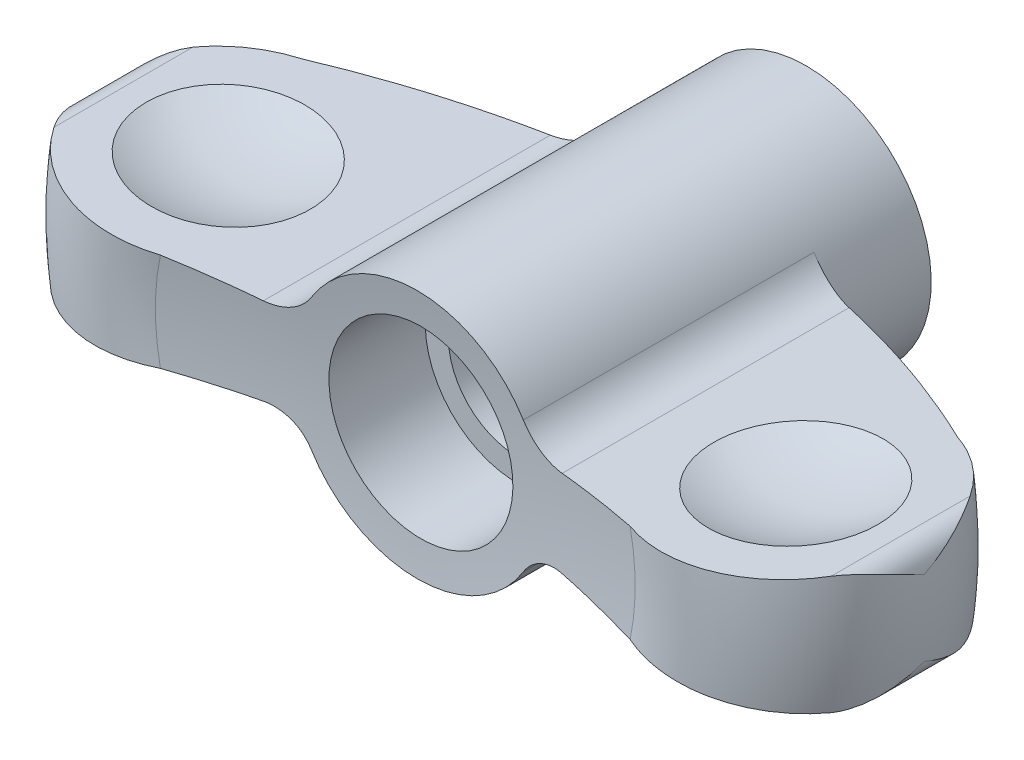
ISO-10303-21;
HEADER;
FILE_DESCRIPTION(('STEP AP214'),'2;1');
FILE_NAME('part.step','',(''),(''),'','','');
FILE_SCHEMA(('AUTOMOTIVE_DESIGN { 1 0 10303 214 1 1 1 1 }'));
ENDSEC;
DATA;
#1=APPLICATION_CONTEXT('core data for automotive mechanical design processes');
#2=APPLICATION_PROTOCOL_DEFINITION('international standard','automotive_design',2000,#1);
#3=PRODUCT_CONTEXT('',#1,'mechanical');
#4=PRODUCT('Part','Part','',(#3));
#5=PRODUCT_RELATED_PRODUCT_CATEGORY('part','',(#4));
#6=PRODUCT_DEFINITION_FORMATION('','',#4);
#7=PRODUCT_DEFINITION_CONTEXT('part definition',#1,'design');
#8=PRODUCT_DEFINITION('design','',#6,#7);
#9=PRODUCT_DEFINITION_SHAPE('','',#8);
#10=(LENGTH_UNIT() NAMED_UNIT(*) SI_UNIT(.MILLI.,.METRE.));
#11=(NAMED_UNIT(*) PLANE_ANGLE_UNIT() SI_UNIT($,.RADIAN.));
#12=(NAMED_UNIT(*) SI_UNIT($,.STERADIAN.) SOLID_ANGLE_UNIT());
#13=UNCERTAINTY_MEASURE_WITH_UNIT(LENGTH_MEASURE(1.E-05),#10,'distance_accuracy_value','');
#14=(GEOMETRIC_REPRESENTATION_CONTEXT(3) GLOBAL_UNCERTAINTY_ASSIGNED_CONTEXT((#13)) GLOBAL_UNIT_ASSIGNED_CONTEXT((#10,
#11,#12)) REPRESENTATION_CONTEXT('',''));
#15=CARTESIAN_POINT('',(0.,0.,0.));
#16=DIRECTION('',(0.,0.,1.));
#17=DIRECTION('',(1.,0.,0.));
#18=AXIS2_PLACEMENT_3D('',#15,#16,#17);
#19=CARTESIAN_POINT('',(0.,0.,22.4));
#20=DIRECTION('',(0.,0.,1.));
#21=DIRECTION('',(-1.09310760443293E-09,1.,0.));
#22=AXIS2_PLACEMENT_3D('',#19,#20,#21);
#23=TOROIDAL_SURFACE('',#22,21.8999999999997,9.6);
#24=CARTESIAN_POINT('',(-18.1474454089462,-3.75149992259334,13.4105144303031));
#25=CARTESIAN_POINT('',(-17.8905850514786,-3.73467864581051,13.5060281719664));
#26=CARTESIAN_POINT('',(-17.637760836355,-3.71812168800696,13.6124268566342));
#27=CARTESIAN_POINT('',(-17.1419285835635,-3.68565061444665,13.8461211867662));
#28=CARTESIAN_POINT('',(-16.8989202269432,-3.66973647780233,13.9734161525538));
#29=CARTESIAN_POINT('',(-16.424509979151,-3.63866828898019,14.2479997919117));
#30=CARTESIAN_POINT('',(-16.1931050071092,-3.62351403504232,14.3952831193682));
#31=CARTESIAN_POINT('',(-15.7434802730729,-3.59406900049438,14.7088327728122));
#32=CARTESIAN_POINT('',(-15.5252603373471,-3.579778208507,14.8750988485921));
#33=CARTESIAN_POINT('',(-15.1034606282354,-3.55215537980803,15.2255617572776));
#34=CARTESIAN_POINT('',(-14.8998888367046,-3.53882386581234,15.409768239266));
#35=CARTESIAN_POINT('',(-14.5090032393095,-3.51322554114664,15.7947666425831));
#36=CARTESIAN_POINT('',(-14.3216896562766,-3.50095874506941,15.995558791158));
#37=CARTESIAN_POINT('',(-13.964772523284,-3.47758494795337,16.4122828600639));
#38=CARTESIAN_POINT('',(-13.7951642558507,-3.46647763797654,16.6282107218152));
#39=CARTESIAN_POINT('',(-13.4749045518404,-3.44550446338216,17.0737519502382));
#40=CARTESIAN_POINT('',(-13.3242529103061,-3.43563858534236,17.3033651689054));
#41=CARTESIAN_POINT('',(-13.0439598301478,-3.41728274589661,17.7732237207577));
#42=CARTESIAN_POINT('',(-12.9141954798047,-3.40878473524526,18.0133954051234));
#43=CARTESIAN_POINT('',(-12.6756273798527,-3.39316138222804,18.5039680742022));
#44=CARTESIAN_POINT('',(-12.5668227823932,-3.3860359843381,18.754368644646));
#45=CARTESIAN_POINT('',(-12.3710778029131,-3.37321703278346,19.2636307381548));
#46=CARTESIAN_POINT('',(-12.284138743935,-3.36752356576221,19.5224927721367));
#47=CARTESIAN_POINT('',(-12.1328924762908,-3.35761874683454,20.0467739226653));
#48=CARTESIAN_POINT('',(-12.06858489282,-3.35340737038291,20.3121929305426));
#49=CARTESIAN_POINT('',(-11.9641647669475,-3.34656910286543,20.8426066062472));
#50=CARTESIAN_POINT('',(-11.9236219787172,-3.34391403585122,21.1075162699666));
#51=CARTESIAN_POINT('',(-11.8652424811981,-3.34009087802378,21.639835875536));
#52=CARTESIAN_POINT('',(-11.8474054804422,-3.33892276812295,21.9072457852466));
#53=CARTESIAN_POINT('',(-11.8345982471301,-3.33808404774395,22.4425774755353));
#54=CARTESIAN_POINT('',(-11.8396248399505,-3.33841322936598,22.7104991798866));
#55=CARTESIAN_POINT('',(-11.8724923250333,-3.34056565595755,23.2449323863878));
#56=CARTESIAN_POINT('',(-11.9003330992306,-3.34238889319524,23.5114438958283));
#57=CARTESIAN_POINT('',(-11.9780680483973,-3.34747960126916,24.0376567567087));
#58=CARTESIAN_POINT('',(-12.027669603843,-3.35072790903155,24.2974015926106));
#59=CARTESIAN_POINT('',(-12.1484267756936,-3.35863605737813,24.8118052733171));
#60=CARTESIAN_POINT('',(-12.2195821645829,-3.36329588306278,25.0664641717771));
#61=CARTESIAN_POINT('',(-12.382844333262,-3.37398759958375,25.5689078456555));
#62=CARTESIAN_POINT('',(-12.4749485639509,-3.38001932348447,25.8166934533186));
#63=CARTESIAN_POINT('',(-12.6794078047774,-3.3934089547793,26.3038316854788));
#64=CARTESIAN_POINT('',(-12.7917703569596,-3.40076735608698,26.5431811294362));
#65=CARTESIAN_POINT('',(-13.0369078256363,-3.41682092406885,27.0137884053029));
#66=CARTESIAN_POINT('',(-13.1698514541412,-3.42552713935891,27.2449579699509));
#67=CARTESIAN_POINT('',(-13.4544154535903,-3.44416267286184,27.69545672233));
#68=CARTESIAN_POINT('',(-13.6060365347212,-3.45409203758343,27.914785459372));
#69=CARTESIAN_POINT('',(-13.9268367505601,-3.47510060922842,28.3401572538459));
#70=CARTESIAN_POINT('',(-14.0960166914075,-3.4861798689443,28.5461997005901));
#71=CARTESIAN_POINT('',(-14.4507138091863,-3.50940828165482,28.9436423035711));
#72=CARTESIAN_POINT('',(-14.6362312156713,-3.52155744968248,29.1350422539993));
#73=CARTESIAN_POINT('',(-15.0260268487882,-3.54708439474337,29.5054914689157));
#74=CARTESIAN_POINT('',(-15.2305978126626,-3.56048134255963,29.6842314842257));
#75=CARTESIAN_POINT('',(-15.6538967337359,-3.58820235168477,30.0239900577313));
#76=CARTESIAN_POINT('',(-15.8726245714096,-3.60252640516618,30.1850087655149));
#77=CARTESIAN_POINT('',(-16.3227525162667,-3.6320043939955,30.4882695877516));
#78=CARTESIAN_POINT('',(-16.5541555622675,-3.64715852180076,30.6305073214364));
#79=CARTESIAN_POINT('',(-17.0278914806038,-3.67818255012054,30.8951425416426));
#80=CARTESIAN_POINT('',(-17.2702206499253,-3.69405220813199,31.017546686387));
#81=CARTESIAN_POINT('',(-17.7669669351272,-3.72658313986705,31.2429802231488));
#82=CARTESIAN_POINT('',(-18.0214889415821,-3.74325128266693,31.3457775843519));
#83=CARTESIAN_POINT('',(-18.5382654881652,-3.77709395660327,31.5295393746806));
#84=CARTESIAN_POINT('',(-18.8005200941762,-3.79426849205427,31.6105036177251));
#85=CARTESIAN_POINT('',(-19.3309113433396,-3.82900276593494,31.7500060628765));
#86=CARTESIAN_POINT('',(-19.5990481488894,-3.8465625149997,31.8085436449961));
#87=CARTESIAN_POINT('',(-20.1392890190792,-3.88194182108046,31.9027453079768));
#88=CARTESIAN_POINT('',(-20.411393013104,-3.899761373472,31.9384097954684));
#89=CARTESIAN_POINT('',(-20.9576381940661,-3.93553388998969,31.9865808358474));
#90=CARTESIAN_POINT('',(-21.2317794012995,-3.95348685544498,31.9990871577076));
#91=CARTESIAN_POINT('',(-21.7801364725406,-3.98939767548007,32.0008164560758));
#92=CARTESIAN_POINT('',(-22.0543523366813,-4.00735553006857,31.9900393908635));
#93=CARTESIAN_POINT('',(-22.6008596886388,-4.04314521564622,31.9452447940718));
#94=CARTESIAN_POINT('',(-22.8731513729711,-4.06097705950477,31.9112296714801));
#95=CARTESIAN_POINT('',(-23.4138724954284,-4.09638781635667,31.8201695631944));
#96=CARTESIAN_POINT('',(-23.6823019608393,-4.11396673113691,31.7631247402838));
#97=CARTESIAN_POINT('',(-24.2118784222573,-4.14864764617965,31.6267614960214));
#98=CARTESIAN_POINT('',(-24.4730575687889,-4.16575175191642,31.5475684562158));
#99=CARTESIAN_POINT('',(-24.9877954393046,-4.19946091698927,31.3673123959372));
#100=CARTESIAN_POINT('',(-25.2413540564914,-4.21606596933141,31.2662490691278));
#101=CARTESIAN_POINT('',(-25.7391278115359,-4.2486641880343,31.0428965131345));
#102=CARTESIAN_POINT('',(-25.983338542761,-4.26465706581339,30.9205974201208));
#103=CARTESIAN_POINT('',(-26.4605066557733,-4.29590586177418,30.6556646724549));
#104=CARTESIAN_POINT('',(-26.6934645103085,-4.31116181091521,30.5130318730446));
#105=CARTESIAN_POINT('',(-27.1452633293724,-4.34074922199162,30.2092249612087));
#106=CARTESIAN_POINT('',(-27.3641711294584,-4.35508506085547,30.0481506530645));
#107=CARTESIAN_POINT('',(-27.7875858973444,-4.38281365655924,29.708008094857));
#108=CARTESIAN_POINT('',(-27.9920934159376,-4.39620644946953,29.5289405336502));
#109=CARTESIAN_POINT('',(-28.3848624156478,-4.42192811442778,29.1544313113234));
#110=CARTESIAN_POINT('',(-28.5731528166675,-4.43425888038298,28.9590200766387));
#111=CARTESIAN_POINT('',(-28.9324617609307,-4.45778931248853,28.5530043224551));
#112=CARTESIAN_POINT('',(-29.1034908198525,-4.46898966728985,28.3424091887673));
#113=CARTESIAN_POINT('',(-29.3193740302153,-4.48312743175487,28.0522910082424));
#114=CARTESIAN_POINT('',(-29.3724491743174,-4.48660321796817,27.978811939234));
#115=CARTESIAN_POINT('',(-29.476441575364,-4.49341347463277,27.8304567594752));
#116=CARTESIAN_POINT('',(-29.5273611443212,-4.49674809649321,27.7555822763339));
#117=CARTESIAN_POINT('',(-29.5772181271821,-4.50001313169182,27.6799919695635));
#118=B_SPLINE_CURVE_WITH_KNOTS('',3,(#24,#25,#26,#27,#28,#29,#30,#31,#32,#33,#34,#35,#36,#37,
#38,#39,#40,#41,#42,#43,#44,#45,#46,#47,#48,#49,#50,#51,#52,#53,#54,#55,#56,#57,#58,#59,#60,#61,
#62,#63,#64,#65,#66,#67,#68,#69,#70,#71,#72,#73,#74,#75,#76,#77,#78,#79,#80,#81,#82,#83,#84,#85,
#86,#87,#88,#89,#90,#91,#92,#93,#94,#95,#96,#97,#98,#99,#100,#101,#102,#103,#104,#105,#106,#107,
#108,#109,#110,#111,#112,#113,#114,#115,#116,#117),.UNSPECIFIED.,.F.,.F.,(4,2,2,2,2,2,2,2,2,2,2,
2,2,2,2,2,2,2,2,2,2,2,2,2,2,2,2,2,2,2,2,2,2,2,2,2,2,2,2,2,2,2,2,2,2,2,4),(0.,0.823429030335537,
1.64683128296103,2.47001373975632,3.29318534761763,4.11680216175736,4.94043026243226,
5.76383834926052,6.5872375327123,7.40559872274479,8.22392680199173,9.04230438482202,
9.8606684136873,10.6637182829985,11.4667578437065,12.2696859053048,13.0726098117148,
13.8650526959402,14.6574872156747,15.449825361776,16.2424591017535,17.0419728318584,
17.8415169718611,18.6410978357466,19.4406899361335,20.2556974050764,21.070697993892,
21.8858883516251,22.7008044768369,23.5248358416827,24.3488742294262,25.1729353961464,
25.9969819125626,26.8210366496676,27.6450928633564,28.4690636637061,29.2930286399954,
30.1124203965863,30.9318236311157,31.7516084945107,32.5713588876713,33.3868657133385,
34.2023413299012,35.0163312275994,35.8298222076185,36.1019244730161,36.3737270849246),.UNSPECIFIED.);
#119=CARTESIAN_POINT('',(-17.8721248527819,-3.73346972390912,31.2823000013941));
#120=VERTEX_POINT('',#119);
#121=CARTESIAN_POINT('',(-29.5770181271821,-4.50000003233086,27.6802951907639));
#122=VERTEX_POINT('',#121);
#123=EDGE_CURVE('E175',#120,#122,#118,.T.);
#124=ORIENTED_EDGE('',*,*,#123,.F.);
#125=CARTESIAN_POINT('',(0.,0.,31.2823000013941));
#126=DIRECTION('',(0.,0.,1.));
#127=DIRECTION('',(-1.09310760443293E-09,1.,0.));
#128=AXIS2_PLACEMENT_3D('',#125,#126,#127);
#129=CIRCLE('',#128,18.2579200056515);
#130=CARTESIAN_POINT('',(-17.8721248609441,3.7334696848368,31.2823000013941));
#131=VERTEX_POINT('',#130);
#132=EDGE_CURVE('E187',#131,#120,#129,.T.);
#133=ORIENTED_EDGE('',*,*,#132,.F.);
#134=CARTESIAN_POINT('',(-29.5772181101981,4.50001306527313,27.6799920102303));
#135=CARTESIAN_POINT('',(-29.4283813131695,4.49026603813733,27.9057071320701));
#136=CARTESIAN_POINT('',(-29.2699701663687,4.47989200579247,28.125073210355));
#137=CARTESIAN_POINT('',(-28.9352574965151,4.4579723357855,28.5496181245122));
#138=CARTESIAN_POINT('',(-28.7589571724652,4.44642677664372,28.7547979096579));
#139=CARTESIAN_POINT('',(-28.3898682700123,4.42225587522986,29.1493363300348));
#140=CARTESIAN_POINT('',(-28.1970944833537,4.40963150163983,29.3387088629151));
#141=CARTESIAN_POINT('',(-27.7963194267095,4.38338553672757,29.700509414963));
#142=CARTESIAN_POINT('',(-27.5883182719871,4.36976395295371,29.8729375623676));
#143=CARTESIAN_POINT('',(-27.1584989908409,4.3416159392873,30.1997036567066));
#144=CARTESIAN_POINT('',(-26.9366758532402,4.32708918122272,30.3540349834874));
#145=CARTESIAN_POINT('',(-26.4808650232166,4.29723903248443,30.6434656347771));
#146=CARTESIAN_POINT('',(-26.2468771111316,4.28191562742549,30.7785646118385));
#147=CARTESIAN_POINT('',(-25.7684462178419,4.25058413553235,31.0285776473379));
#148=CARTESIAN_POINT('',(-25.5240048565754,4.23457615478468,31.1434948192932));
#149=CARTESIAN_POINT('',(-25.0263706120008,4.20198707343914,31.3523874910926));
#150=CARTESIAN_POINT('',(-24.7731777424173,4.18540597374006,31.446363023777));
#151=CARTESIAN_POINT('',(-24.2590478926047,4.1517366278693,31.612996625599));
#152=CARTESIAN_POINT('',(-23.9980896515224,4.13464698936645,31.6855888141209));
#153=CARTESIAN_POINT('',(-23.4709078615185,4.10012289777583,31.8086173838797));
#154=CARTESIAN_POINT('',(-23.2046821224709,4.08268830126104,31.8590443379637));
#155=CARTESIAN_POINT('',(-22.6689091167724,4.04760158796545,31.9373839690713));
#156=CARTESIAN_POINT('',(-22.399361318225,4.02994943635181,31.9652929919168));
#157=CARTESIAN_POINT('',(-21.858996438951,3.99456201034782,31.9984159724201));
#158=CARTESIAN_POINT('',(-21.5881799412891,3.97682677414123,32.003639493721));
#159=CARTESIAN_POINT('',(-21.0454404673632,3.94128384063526,31.9913795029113));
#160=CARTESIAN_POINT('',(-20.7735205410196,3.92347634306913,31.9737602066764));
#161=CARTESIAN_POINT('',(-20.232112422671,3.88802059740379,31.9157373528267));
#162=CARTESIAN_POINT('',(-19.9626242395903,3.87037234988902,31.8753337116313));
#163=CARTESIAN_POINT('',(-19.4280257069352,3.83536255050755,31.7720671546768));
#164=CARTESIAN_POINT('',(-19.1629144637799,3.81800094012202,31.7092088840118));
#165=CARTESIAN_POINT('',(-18.6387730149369,3.78367595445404,31.5614710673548));
#166=CARTESIAN_POINT('',(-18.3797450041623,3.76671272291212,31.4765837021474));
#167=CARTESIAN_POINT('',(-17.8682212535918,3.73321404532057,31.2848646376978));
#168=CARTESIAN_POINT('',(-17.6157711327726,3.7166815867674,31.1779106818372));
#169=CARTESIAN_POINT('',(-17.1207308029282,3.68426237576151,30.9431230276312));
#170=CARTESIAN_POINT('',(-16.878140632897,3.66837562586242,30.815289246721));
#171=CARTESIAN_POINT('',(-16.404527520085,3.63735964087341,30.5396362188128));
#172=CARTESIAN_POINT('',(-16.1735051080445,3.62223044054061,30.3918160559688));
#173=CARTESIAN_POINT('',(-15.7246795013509,3.59283774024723,30.0772205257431));
#174=CARTESIAN_POINT('',(-15.5068766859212,3.57857426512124,29.9104446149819));
#175=CARTESIAN_POINT('',(-15.0856203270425,3.55098702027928,29.5587225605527));
#176=CARTESIAN_POINT('',(-14.8821981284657,3.53766530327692,29.3737387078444));
#177=CARTESIAN_POINT('',(-14.4917116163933,3.51209311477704,28.9871837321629));
#178=CARTESIAN_POINT('',(-14.3046468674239,3.49984261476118,28.7856130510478));
#179=CARTESIAN_POINT('',(-13.948272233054,3.47650434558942,28.367276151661));
#180=CARTESIAN_POINT('',(-13.7789624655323,3.46541658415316,28.1505098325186));
#181=CARTESIAN_POINT('',(-13.4594078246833,3.44448958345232,27.7032976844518));
#182=CARTESIAN_POINT('',(-13.3091626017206,3.43465032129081,27.4728521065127));
#183=CARTESIAN_POINT('',(-13.0300075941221,3.41636901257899,27.0017206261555));
#184=CARTESIAN_POINT('',(-12.9009427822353,3.40791681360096,26.7611269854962));
#185=CARTESIAN_POINT('',(-12.6638563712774,3.39239049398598,26.2698561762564));
#186=CARTESIAN_POINT('',(-12.55582645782,3.38531582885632,26.0191830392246));
#187=CARTESIAN_POINT('',(-12.3616487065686,3.37259951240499,25.5094385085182));
#188=CARTESIAN_POINT('',(-12.2755026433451,3.36695797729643,25.2503664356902));
#189=CARTESIAN_POINT('',(-12.1258566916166,3.35715796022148,24.7257346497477));
#190=CARTESIAN_POINT('',(-12.0623564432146,3.35299945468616,24.4601750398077));
#191=CARTESIAN_POINT('',(-11.9595441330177,3.34626648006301,23.9295575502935));
#192=CARTESIAN_POINT('',(-11.9198013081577,3.34366380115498,23.6645834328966));
#193=CARTESIAN_POINT('',(-11.8630211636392,3.33994538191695,23.1322038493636));
#194=CARTESIAN_POINT('',(-11.8459835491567,3.33882962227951,22.8647984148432));
#195=CARTESIAN_POINT('',(-11.8347668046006,3.33809505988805,22.3295252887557));
#196=CARTESIAN_POINT('',(-11.8405861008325,3.33847615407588,22.0616576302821));
#197=CARTESIAN_POINT('',(-11.875027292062,3.34073163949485,21.5273997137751));
#198=CARTESIAN_POINT('',(-11.9036490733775,3.34260602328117,21.2610094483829));
#199=CARTESIAN_POINT('',(-11.9829240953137,3.3477975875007,20.7350583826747));
#200=CARTESIAN_POINT('',(-12.0332886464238,3.35109586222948,20.475453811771));
#201=CARTESIAN_POINT('',(-12.1555550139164,3.35910284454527,19.9613934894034));
#202=CARTESIAN_POINT('',(-12.2274566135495,3.36381153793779,19.7069376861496));
#203=CARTESIAN_POINT('',(-12.3921774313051,3.37459877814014,19.2049950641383));
#204=CARTESIAN_POINT('',(-12.4849912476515,3.38067697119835,18.9575064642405));
#205=CARTESIAN_POINT('',(-12.6908448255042,3.39415791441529,18.4709993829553));
#206=CARTESIAN_POINT('',(-12.8038936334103,3.40156125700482,18.2319847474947));
#207=CARTESIAN_POINT('',(-13.0503991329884,3.41770441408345,17.7620583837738));
#208=CARTESIAN_POINT('',(-13.1840279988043,3.42645550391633,17.5312373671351));
#209=CARTESIAN_POINT('',(-13.4698675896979,3.44517457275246,17.0815911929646));
#210=CARTESIAN_POINT('',(-13.6220707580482,3.4551420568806,16.8627612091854));
#211=CARTESIAN_POINT('',(-13.9440945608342,3.47623075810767,16.4382825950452));
#212=CARTESIAN_POINT('',(-14.1139279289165,3.48735280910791,16.2326436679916));
#213=CARTESIAN_POINT('',(-14.4698944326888,3.51066435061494,15.8360721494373));
#214=CARTESIAN_POINT('',(-14.6560271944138,3.52285381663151,15.6451392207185));
#215=CARTESIAN_POINT('',(-15.0471805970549,3.54846967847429,15.2755429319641));
#216=CARTESIAN_POINT('',(-15.2525053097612,3.56191598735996,15.0972026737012));
#217=CARTESIAN_POINT('',(-15.6772923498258,3.58973444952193,14.7583242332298));
#218=CARTESIAN_POINT('',(-15.8967545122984,3.60410659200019,14.5977858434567));
#219=CARTESIAN_POINT('',(-16.3478939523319,3.63365082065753,14.2958496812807));
#220=CARTESIAN_POINT('',(-16.5795509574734,3.648821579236,14.1544214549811));
#221=CARTESIAN_POINT('',(-17.0537037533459,3.67987290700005,13.8914238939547));
#222=CARTESIAN_POINT('',(-17.2961933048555,3.69575306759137,13.7698433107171));
#223=CARTESIAN_POINT('',(-17.6425873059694,3.71843772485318,13.6138611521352));
#224=CARTESIAN_POINT('',(-17.74267739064,3.7249924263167,13.5707938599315));
#225=CARTESIAN_POINT('',(-17.9441132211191,3.73818406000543,13.4880908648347));
#226=CARTESIAN_POINT('',(-18.0454572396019,3.74482087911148,13.4484509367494));
#227=CARTESIAN_POINT('',(-18.1474454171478,3.75149988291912,13.4105144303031));
#228=B_SPLINE_CURVE_WITH_KNOTS('',3,(#134,#135,#136,#137,#138,#139,#140,#141,#142,#143,#144,
#145,#146,#147,#148,#149,#150,#151,#152,#153,#154,#155,#156,#157,#158,#159,#160,#161,#162,#163,
#164,#165,#166,#167,#168,#169,#170,#171,#172,#173,#174,#175,#176,#177,#178,#179,#180,#181,#182,
#183,#184,#185,#186,#187,#188,#189,#190,#191,#192,#193,#194,#195,#196,#197,#198,#199,#200,#201,
#202,#203,#204,#205,#206,#207,#208,#209,#210,#211,#212,#213,#214,#215,#216,#217,#218,#219,#220,
#221,#222,#223,#224,#225,#226,#227),.UNSPECIFIED.,.F.,.F.,(4,2,2,2,2,2,2,2,2,2,2,2,2,2,2,2,2,2,
2,2,2,2,2,2,2,2,2,2,2,2,2,2,2,2,2,2,2,2,2,2,2,2,2,2,2,2,4),(0.,0.81138385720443,
1.62271336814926,2.43332187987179,3.24392425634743,4.05482224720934,4.86573488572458,
5.6765223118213,6.48730846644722,7.30056707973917,8.11417124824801,8.92790742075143,
9.74130050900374,10.5595508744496,11.3778042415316,12.1958884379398,13.0142634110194,
13.8373004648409,14.6603407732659,15.4834188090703,16.3065204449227,17.131364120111,
17.9561858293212,18.7810130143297,19.6058250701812,20.4243011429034,21.242453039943,
22.0606712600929,22.8788764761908,23.6817568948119,24.484626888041,25.2874416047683,
26.0902523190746,26.8827166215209,27.6751729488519,28.4674248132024,29.2600317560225,
30.0596712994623,30.8589865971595,31.6588832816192,32.458761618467,33.2746912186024,
34.0906113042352,34.905215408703,35.7193562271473,36.0467859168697,36.3738060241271),.UNSPECIFIED.);
#229=CARTESIAN_POINT('',(-29.577018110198,4.49999996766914,27.6802952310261));
#230=VERTEX_POINT('',#229);
#231=EDGE_CURVE('E289',#230,#131,#228,.T.);
#232=ORIENTED_EDGE('',*,*,#231,.F.);
#233=CARTESIAN_POINT('',(-31.3695646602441,2.86363632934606,22.4));
#234=CARTESIAN_POINT('',(-31.3693228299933,2.86628555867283,22.4059654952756));
#235=CARTESIAN_POINT('',(-31.3690751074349,2.86893434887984,22.4119311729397));
#236=CARTESIAN_POINT('',(-31.3455550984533,3.11453940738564,22.9652019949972));
#237=CARTESIAN_POINT('',(-31.2727100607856,3.35362318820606,23.5139845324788));
#238=CARTESIAN_POINT('',(-31.0906514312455,3.68216337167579,24.3317563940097));
#239=CARTESIAN_POINT('',(-31.0177760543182,3.78670942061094,24.6035877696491));
#240=CARTESIAN_POINT('',(-30.8477677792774,3.98135438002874,25.1449637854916));
#241=CARTESIAN_POINT('',(-30.7506472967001,4.07146064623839,25.4145095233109));
#242=CARTESIAN_POINT('',(-30.5719332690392,4.20252897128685,25.8529322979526));
#243=CARTESIAN_POINT('',(-30.4974342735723,4.24947679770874,26.0229493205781));
#244=CARTESIAN_POINT('',(-30.3388744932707,4.33328279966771,26.3608778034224));
#245=CARTESIAN_POINT('',(-30.2548212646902,4.37014887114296,26.5287908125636));
#246=CARTESIAN_POINT('',(-30.0769796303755,4.43174326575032,26.8627513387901));
#247=CARTESIAN_POINT('',(-29.9831491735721,4.45641629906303,27.0287870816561));
#248=CARTESIAN_POINT('',(-29.8357178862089,4.48201224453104,27.2752518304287));
#249=CARTESIAN_POINT('',(-29.7853951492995,4.48864303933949,27.3570723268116));
#250=CARTESIAN_POINT('',(-29.6826484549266,4.49763621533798,27.5196657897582));
#251=CARTESIAN_POINT('',(-29.630223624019,4.49999680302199,27.6004383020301));
#252=CARTESIAN_POINT('',(-29.5768181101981,4.49999995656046,27.6805954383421));
#253=B_SPLINE_CURVE_WITH_KNOTS('',3,(#233,#234,#235,#236,#237,#238,#239,#240,#241,#242,#243,
#244,#245,#246,#247,#248,#249,#250,#251,#252),.UNSPECIFIED.,.F.,.F.,(4,2,2,2,2,2,2,2,2,4),(0.,
0.0195959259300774,1.81731826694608,2.71712331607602,3.61646853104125,4.19044381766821,
4.76396827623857,5.34007007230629,5.62881792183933,5.9176870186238),.UNSPECIFIED.);
#254=CARTESIAN_POINT('',(-31.3695646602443,2.86363632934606,22.4));
#255=VERTEX_POINT('',#254);
#256=EDGE_CURVE('E346',#255,#230,#253,.T.);
#257=ORIENTED_EDGE('',*,*,#256,.F.);
#258=CARTESIAN_POINT('',(-29.576818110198,4.49999995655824,17.119404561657));
#259=CARTESIAN_POINT('',(-29.6191393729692,4.50000099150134,17.1829266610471));
#260=CARTESIAN_POINT('',(-29.6608485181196,4.4985171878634,17.2468391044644));
#261=CARTESIAN_POINT('',(-29.7429683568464,4.49280696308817,17.3753522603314));
#262=CARTESIAN_POINT('',(-29.7833793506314,4.48858118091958,17.4399528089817));
#263=CARTESIAN_POINT('',(-29.9024609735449,4.47214702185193,17.6344933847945));
#264=CARTESIAN_POINT('',(-29.9791105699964,4.4561804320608,17.7653678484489));
#265=CARTESIAN_POINT('',(-30.1263186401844,4.41582921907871,18.0284830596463));
#266=CARTESIAN_POINT('',(-30.1969002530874,4.39147852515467,18.1607162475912));
#267=CARTESIAN_POINT('',(-30.3321494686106,4.33558285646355,18.426742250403));
#268=CARTESIAN_POINT('',(-30.3968138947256,4.30403404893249,18.5605358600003));
#269=CARTESIAN_POINT('',(-30.5626786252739,4.21088532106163,18.9222641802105));
#270=CARTESIAN_POINT('',(-30.658240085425,4.14358637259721,19.1513508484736));
#271=CARTESIAN_POINT('',(-30.8316829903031,3.99568948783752,19.6118454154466));
#272=CARTESIAN_POINT('',(-30.9095558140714,3.91508509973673,19.8432543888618));
#273=CARTESIAN_POINT('',(-31.1166837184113,3.6580671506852,20.5407057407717));
#274=CARTESIAN_POINT('',(-31.2192514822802,3.46657221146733,21.0095421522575));
#275=CARTESIAN_POINT('',(-31.3069727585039,3.20184753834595,21.6292554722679));
#276=CARTESIAN_POINT('',(-31.3245600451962,3.13661932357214,21.7798368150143));
#277=CARTESIAN_POINT('',(-31.3522803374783,3.00489987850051,22.080989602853));
#278=CARTESIAN_POINT('',(-31.3624220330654,2.93841021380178,22.2315608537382));
#279=CARTESIAN_POINT('',(-31.3690750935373,2.86893441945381,22.3880686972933));
#280=CARTESIAN_POINT('',(-31.3693228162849,2.86628562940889,22.3940343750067));
#281=CARTESIAN_POINT('',(-31.3695646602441,2.86363632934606,22.4));
#282=B_SPLINE_CURVE_WITH_KNOTS('',3,(#258,#259,#260,#261,#262,#263,#264,#265,#266,#267,#268,
#269,#270,#271,#272,#273,#274,#275,#276,#277,#278,#279,#280,#281),.UNSPECIFIED.,.F.,.F.,(4,2,2,
2,2,2,2,2,2,2,2,4),(0.,0.228945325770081,0.457837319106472,0.914918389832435,1.37017104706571,
1.8256666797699,2.59598824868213,3.36668444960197,4.90952775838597,5.40460012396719,
5.89909375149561,5.91868967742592),.UNSPECIFIED.);
#283=CARTESIAN_POINT('',(-29.577018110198,4.49999996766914,17.1197047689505));
#284=VERTEX_POINT('',#283);
#285=EDGE_CURVE('E339',#284,#255,#282,.T.);
#286=ORIENTED_EDGE('',*,*,#285,.F.);
#287=CARTESIAN_POINT('',(-24.9182172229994,4.19490432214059,13.4105144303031));
#288=CARTESIAN_POINT('',(-25.174728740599,4.21170275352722,13.506320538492));
#289=CARTESIAN_POINT('',(-25.4271515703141,4.22823342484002,13.6131252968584));
#290=CARTESIAN_POINT('',(-25.9220334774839,4.26064226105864,13.8478633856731));
#291=CARTESIAN_POINT('',(-26.1644920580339,4.27652039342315,13.9757977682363));
#292=CARTESIAN_POINT('',(-26.6315223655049,4.30710528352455,14.2483504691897));
#293=CARTESIAN_POINT('',(-26.8563943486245,4.32183170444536,14.3924524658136));
#294=CARTESIAN_POINT('',(-27.2933789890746,4.35044896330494,14.6988790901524));
#295=CARTESIAN_POINT('',(-27.5054935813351,4.36433992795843,14.8612009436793));
#296=CARTESIAN_POINT('',(-27.888316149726,4.38941021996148,15.1803070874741));
#297=CARTESIAN_POINT('',(-28.0607864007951,4.40070495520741,15.3349749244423));
#298=CARTESIAN_POINT('',(-28.3941147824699,4.42253397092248,15.656391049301));
#299=CARTESIAN_POINT('',(-28.5549737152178,4.43306830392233,15.8231385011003));
#300=CARTESIAN_POINT('',(-28.8677866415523,4.45355380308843,16.1718241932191));
#301=CARTESIAN_POINT('',(-29.0194509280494,4.463485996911,16.3540235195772));
#302=CARTESIAN_POINT('',(-29.3089338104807,4.4824436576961,16.7291933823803));
#303=CARTESIAN_POINT('',(-29.4467504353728,4.49146899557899,16.9221654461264));
#304=CARTESIAN_POINT('',(-29.577218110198,4.50001306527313,17.1200079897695));
#305=B_SPLINE_CURVE_WITH_KNOTS('',3,(#287,#288,#289,#290,#291,#292,#293,#294,#295,#296,#297,
#298,#299,#300,#301,#302,#303,#304),.UNSPECIFIED.,.F.,.F.,(4,2,2,2,2,2,2,2,4),(0.,
0.822759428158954,1.64555983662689,2.44710662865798,3.24853154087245,3.94375872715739,
4.6389378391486,5.35009750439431,6.06135825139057),.UNSPECIFIED.);
#306=CARTESIAN_POINT('',(-24.9187524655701,4.19493937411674,13.4107144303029));
#307=VERTEX_POINT('',#306);
#308=EDGE_CURVE('E280',#307,#284,#305,.T.);
#309=ORIENTED_EDGE('',*,*,#308,.F.);
#310=CARTESIAN_POINT('',(0.,0.,13.4107144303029));
#311=DIRECTION('',(0.,0.,1.));
#312=DIRECTION('',(-1.09310760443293E-09,1.,0.));
#313=AXIS2_PLACEMENT_3D('',#310,#311,#312);
#314=CIRCLE('',#313,25.2693834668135);
#315=CARTESIAN_POINT('',(-24.918752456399,-4.1949394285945,13.4107144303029));
#316=VERTEX_POINT('',#315);
#317=EDGE_CURVE('E183',#307,#316,#314,.T.);
#318=ORIENTED_EDGE('',*,*,#317,.T.);
#319=CARTESIAN_POINT('',(-29.5772181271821,-4.50001313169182,17.1200080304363));
#320=CARTESIAN_POINT('',(-29.4265102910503,-4.49014357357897,16.8914517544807));
#321=CARTESIAN_POINT('',(-29.2659808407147,-4.47963081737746,16.6694035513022));
#322=CARTESIAN_POINT('',(-28.9265816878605,-4.45740423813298,16.2398574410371));
#323=CARTESIAN_POINT('',(-28.7477118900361,-4.44569040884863,16.032359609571));
#324=CARTESIAN_POINT('',(-28.3777669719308,-4.42146344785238,15.6385922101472));
#325=CARTESIAN_POINT('',(-28.1871253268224,-4.40897870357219,15.4519133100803));
#326=CARTESIAN_POINT('',(-27.7910307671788,-4.38303925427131,15.0951091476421));
#327=CARTESIAN_POINT('',(-27.5855799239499,-4.36958468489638,14.92498157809));
#328=CARTESIAN_POINT('',(-27.1888740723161,-4.3436052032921,14.6233879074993));
#329=CARTESIAN_POINT('',(-26.9992422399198,-4.33118658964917,14.4897704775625));
#330=CARTESIAN_POINT('',(-26.6108443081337,-4.305751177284,14.2366062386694));
#331=CARTESIAN_POINT('',(-26.4120783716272,-4.29273438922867,14.1170591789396));
#332=CARTESIAN_POINT('',(-26.0017910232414,-4.26586548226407,13.8900697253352));
#333=CARTESIAN_POINT('',(-25.7900813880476,-4.25200103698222,13.7829689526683));
#334=CARTESIAN_POINT('',(-25.3593416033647,-4.22379274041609,13.5846713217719));
#335=CARTESIAN_POINT('',(-25.1403106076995,-4.20944883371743,13.4934763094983));
#336=CARTESIAN_POINT('',(-24.9182172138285,-4.19490437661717,13.4105144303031));
#337=B_SPLINE_CURVE_WITH_KNOTS('',3,(#319,#320,#321,#322,#323,#324,#325,#326,#327,#328,#329,
#330,#331,#332,#333,#334,#335,#336),.UNSPECIFIED.,.F.,.F.,(4,2,2,2,2,2,2,2,4),(0.,
0.821594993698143,1.64319425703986,2.44361485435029,3.24392371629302,3.94026356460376,
4.63659100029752,5.34893291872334,6.06135745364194),.UNSPECIFIED.);
#338=CARTESIAN_POINT('',(-29.5770181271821,-4.50000003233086,17.1197048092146));
#339=VERTEX_POINT('',#338);
#340=EDGE_CURVE('E297',#339,#316,#337,.T.);
#341=ORIENTED_EDGE('',*,*,#340,.F.);
#342=CARTESIAN_POINT('',(-31.3695646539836,-2.86363639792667,22.4));
#343=CARTESIAN_POINT('',(-31.3693228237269,-2.86628562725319,22.3940345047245));
#344=CARTESIAN_POINT('',(-31.3690751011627,-2.86893441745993,22.3880688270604));
#345=CARTESIAN_POINT('',(-31.3455550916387,-3.11453947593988,21.8347980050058));
#346=CARTESIAN_POINT('',(-31.2727100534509,-3.35362325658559,21.2860154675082));
#347=CARTESIAN_POINT('',(-31.0906514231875,-3.6821634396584,20.4682436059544));
#348=CARTESIAN_POINT('',(-31.0177760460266,-3.7867094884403,20.1964122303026));
#349=CARTESIAN_POINT('',(-30.8477677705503,-3.98135444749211,19.6550362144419));
#350=CARTESIAN_POINT('',(-30.7506472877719,-4.07146071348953,19.3854904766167));
#351=CARTESIAN_POINT('',(-30.57193326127,-4.20252903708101,18.9470677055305));
#352=CARTESIAN_POINT('',(-30.4974342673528,-4.24947686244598,18.7770506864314));
#353=CARTESIAN_POINT('',(-30.3388744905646,-4.33328286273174,18.4391222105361));
#354=CARTESIAN_POINT('',(-30.2548212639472,-4.37014893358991,18.2712092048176));
#355=CARTESIAN_POINT('',(-30.0769796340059,-4.43174332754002,17.9372486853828));
#356=CARTESIAN_POINT('',(-29.9831491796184,-4.45641636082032,17.7712129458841));
#357=CARTESIAN_POINT('',(-29.8357178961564,-4.48201230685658,17.5247482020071));
#358=CARTESIAN_POINT('',(-29.7853951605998,-4.48864310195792,17.4429277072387));
#359=CARTESIAN_POINT('',(-29.6826484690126,-4.49763627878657,17.2803342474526));
#360=CARTESIAN_POINT('',(-29.6302236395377,-4.49999686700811,17.1995617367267));
#361=CARTESIAN_POINT('',(-29.5768181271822,-4.50000002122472,17.1194046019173));
#362=B_SPLINE_CURVE_WITH_KNOTS('',3,(#342,#343,#344,#345,#346,#347,#348,#349,#350,#351,#352,
#353,#354,#355,#356,#357,#358,#359,#360,#361),.UNSPECIFIED.,.F.,.F.,(4,2,2,2,2,2,2,2,2,4),(0.,
0.0195959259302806,1.81731826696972,2.7171233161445,3.61646853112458,4.19044380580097,
4.7639682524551,5.34007003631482,5.62881787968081,5.91768697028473),.UNSPECIFIED.);
#363=CARTESIAN_POINT('',(-31.3695646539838,-2.86363639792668,22.4));
#364=VERTEX_POINT('',#363);
#365=EDGE_CURVE('E9',#364,#339,#362,.T.);
#366=ORIENTED_EDGE('',*,*,#365,.F.);
#367=CARTESIAN_POINT('',(-29.5768181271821,-4.50000002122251,27.6805953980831));
#368=CARTESIAN_POINT('',(-29.6191393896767,-4.50000105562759,27.6170732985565));
#369=CARTESIAN_POINT('',(-29.6608485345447,-4.49851725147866,27.553160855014));
#370=CARTESIAN_POINT('',(-29.7429683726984,-4.49280702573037,27.4246476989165));
#371=CARTESIAN_POINT('',(-29.7833793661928,-4.48858124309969,27.3600471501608));
#372=CARTESIAN_POINT('',(-29.9024609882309,-4.47214708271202,27.1655065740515));
#373=CARTESIAN_POINT('',(-29.9791105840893,-4.45618049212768,27.0346321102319));
#374=CARTESIAN_POINT('',(-30.1263186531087,-4.41582927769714,26.7715168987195));
#375=CARTESIAN_POINT('',(-30.1969002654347,-4.3914785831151,26.6392837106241));
#376=CARTESIAN_POINT('',(-30.332149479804,-4.3355829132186,26.3732577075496));
#377=CARTESIAN_POINT('',(-30.3968139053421,-4.3040341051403,26.2394640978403));
#378=CARTESIAN_POINT('',(-30.5626786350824,-4.21088537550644,25.8777357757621));
#379=CARTESIAN_POINT('',(-30.6582400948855,-4.14358642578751,25.6486491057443));
#380=CARTESIAN_POINT('',(-30.8316829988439,-3.99568953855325,25.1881545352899));
#381=CARTESIAN_POINT('',(-30.90955582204,-3.9150851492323,24.9567455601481));
#382=CARTESIAN_POINT('',(-31.1166837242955,-3.65806719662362,24.2592942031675));
#383=CARTESIAN_POINT('',(-31.2192514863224,-3.46657225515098,23.7904577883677));
#384=CARTESIAN_POINT('',(-31.3069727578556,-3.2018475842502,23.1707444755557));
#385=CARTESIAN_POINT('',(-31.324560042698,-3.13661937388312,23.0201631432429));
#386=CARTESIAN_POINT('',(-31.3522803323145,-3.00489993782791,22.7190103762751));
#387=CARTESIAN_POINT('',(-31.3624220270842,-2.93841027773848,22.5684391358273));
#388=CARTESIAN_POINT('',(-31.3690750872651,-2.86893448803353,22.4119313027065));
#389=CARTESIAN_POINT('',(-31.3693228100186,-2.86628569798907,22.4059656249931));
#390=CARTESIAN_POINT('',(-31.3695646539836,-2.86363639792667,22.4));
#391=B_SPLINE_CURVE_WITH_KNOTS('',3,(#367,#368,#369,#370,#371,#372,#373,#374,#375,#376,#377,
#378,#379,#380,#381,#382,#383,#384,#385,#386,#387,#388,#389,#390),.UNSPECIFIED.,.F.,.F.,(4,2,2,
2,2,2,2,2,2,2,2,4),(0.,0.228945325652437,0.45783731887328,0.914918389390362,1.37017104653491,
1.82566667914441,2.59598825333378,3.36668445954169,4.9095277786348,5.40460010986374,
5.89909370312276,5.91868962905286),.UNSPECIFIED.);
#392=EDGE_CURVE('E28',#122,#364,#391,.T.);
#393=ORIENTED_EDGE('',*,*,#392,.F.);
#394=EDGE_LOOP('',(#124,#133,#232,#257,#286,#309,#318,#341,#366,#393));
#395=FACE_BOUND('',#394,.T.);
#396=ADVANCED_FACE('F14',(#395),#23,.T.);
#397=CARTESIAN_POINT('',(0.,0.,76.6132216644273));
#398=DIRECTION('',(0.,0.,1.));
#399=DIRECTION('',(-1.09310760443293E-09,1.,0.));
#400=AXIS2_PLACEMENT_3D('',#397,#398,#399);
#401=DEGENERATE_TOROIDAL_SURFACE('',#400,7.41274216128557,71.1525000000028,.F.);
#402=CARTESIAN_POINT('',(0.,0.,7.5));
#403=DIRECTION('',(0.,0.,1.));
#404=DIRECTION('',(-1.09310760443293E-09,1.,0.));
#405=AXIS2_PLACEMENT_3D('',#402,#403,#404);
#406=CIRCLE('',#405,9.5);
#407=CARTESIAN_POINT('',(8.07537707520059,-5.00382704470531,7.5));
#408=VERTEX_POINT('',#407);
#409=CARTESIAN_POINT('',(8.07537710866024,5.00382699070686,7.5));
#410=VERTEX_POINT('',#409);
#411=EDGE_CURVE('E162',#408,#410,#406,.T.);
#412=ORIENTED_EDGE('',*,*,#411,.T.);
#413=CARTESIAN_POINT('',(8.07525318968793,5.00402699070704,7.50000000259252));
#414=CARTESIAN_POINT('',(8.12665454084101,4.92103774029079,7.4999917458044));
#415=CARTESIAN_POINT('',(8.1814486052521,4.84015820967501,7.5013354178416));
#416=CARTESIAN_POINT('',(8.29736182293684,4.68318006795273,7.50668034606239));
#417=CARTESIAN_POINT('',(8.35847989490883,4.60708064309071,7.51068114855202));
#418=CARTESIAN_POINT('',(8.48644181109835,4.46037529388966,7.52128110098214));
#419=CARTESIAN_POINT('',(8.5532712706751,4.38975637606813,7.52787386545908));
#420=CARTESIAN_POINT('',(8.69224302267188,4.25429557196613,7.54356393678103));
#421=CARTESIAN_POINT('',(8.76438537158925,4.18945374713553,7.55266127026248));
#422=CARTESIAN_POINT('',(8.98795756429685,4.00427130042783,7.5835471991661));
#423=CARTESIAN_POINT('',(9.14667405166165,3.8931121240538,7.60894168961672));
#424=CARTESIAN_POINT('',(9.47864044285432,3.69815735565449,7.66816076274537));
#425=CARTESIAN_POINT('',(9.65189888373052,3.61437798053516,7.70199032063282));
#426=CARTESIAN_POINT('',(10.0125625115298,3.47403572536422,7.77763329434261));
#427=CARTESIAN_POINT('',(10.2002113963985,3.41819607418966,7.81962324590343));
#428=CARTESIAN_POINT('',(10.5805892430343,3.3377434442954,7.90948197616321));
#429=CARTESIAN_POINT('',(10.773313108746,3.31310027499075,7.95734502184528));
#430=CARTESIAN_POINT('',(11.0336535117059,3.30081514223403,8.02491673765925));
#431=CARTESIAN_POINT('',(11.1013248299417,3.2995405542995,8.0427473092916));
#432=CARTESIAN_POINT('',(11.2363731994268,3.30079633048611,8.07885369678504));
#433=CARTESIAN_POINT('',(11.3037505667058,3.30331933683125,8.09712858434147));
#434=CARTESIAN_POINT('',(11.370972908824,3.30772214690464,8.11561851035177));
#435=B_SPLINE_CURVE_WITH_KNOTS('',3,(#413,#414,#415,#416,#417,#418,#419,#420,#421,#422,#423,
#424,#425,#426,#427,#428,#429,#430,#431,#432,#433,#434),.UNSPECIFIED.,.F.,.F.,(4,2,2,2,2,2,2,2,
2,2,4),(0.,0.292752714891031,0.585455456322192,0.877441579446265,1.16943080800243,
1.75277206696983,2.33645821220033,2.93455895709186,3.53208044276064,3.74198071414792,
3.95147483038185),.UNSPECIFIED.);
#436=CARTESIAN_POINT('',(11.370772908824,3.30770904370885,8.1155634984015));
#437=VERTEX_POINT('',#436);
#438=EDGE_CURVE('E151',#410,#437,#435,.T.);
#439=ORIENTED_EDGE('',*,*,#438,.T.);
#440=CARTESIAN_POINT('',(24.9191403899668,4.19496483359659,13.4109144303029));
#441=CARTESIAN_POINT('',(23.8381391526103,4.12417220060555,12.8535823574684));
#442=CARTESIAN_POINT('',(22.7428134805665,4.05244148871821,12.3242059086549));
#443=CARTESIAN_POINT('',(20.5293345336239,3.90748513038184,11.3241128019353));
#444=CARTESIAN_POINT('',(19.4112500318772,3.8342639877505,10.8532432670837));
#445=CARTESIAN_POINT('',(17.1522467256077,3.68632632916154,9.96991193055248));
#446=CARTESIAN_POINT('',(16.0113274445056,3.61160978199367,9.55745134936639));
#447=CARTESIAN_POINT('',(14.2836536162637,3.49846784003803,8.98318373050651));
#448=CARTESIAN_POINT('',(13.7042390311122,3.46052312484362,8.79894257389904));
#449=CARTESIAN_POINT('',(12.5407906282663,3.38433119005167,8.44572577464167));
#450=CARTESIAN_POINT('',(11.9567567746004,3.34608396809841,8.27675025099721));
#451=CARTESIAN_POINT('',(11.370572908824,3.30769594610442,8.115508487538));
#452=B_SPLINE_CURVE_WITH_KNOTS('',3,(#440,#441,#442,#443,#444,#445,#446,#447,#448,#449,#450,
#451),.UNSPECIFIED.,.F.,.F.,(4,2,2,2,2,4),(0.,3.65437061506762,7.29898215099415,
10.9436698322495,12.7710429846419,14.5984303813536),.UNSPECIFIED.);
#453=CARTESIAN_POINT('',(24.918752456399,4.1949394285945,13.4107144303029));
#454=VERTEX_POINT('',#453);
#455=EDGE_CURVE('E210',#454,#437,#452,.T.);
#456=ORIENTED_EDGE('',*,*,#455,.F.);
#457=CARTESIAN_POINT('',(24.9187524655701,-4.19493937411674,13.4107144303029));
#458=VERTEX_POINT('',#457);
#459=EDGE_CURVE('E182',#458,#454,#314,.T.);
#460=ORIENTED_EDGE('',*,*,#459,.F.);
#461=CARTESIAN_POINT('',(11.3705729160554,-3.3076959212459,8.11550848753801));
#462=CARTESIAN_POINT('',(13.3194357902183,-3.43532309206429,8.65165350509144));
#463=CARTESIAN_POINT('',(15.2454387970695,-3.56145321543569,9.27335320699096));
#464=CARTESIAN_POINT('',(19.0285581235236,-3.80920220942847,10.6774595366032));
#465=CARTESIAN_POINT('',(20.8859409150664,-3.93083853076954,11.4591449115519));
#466=CARTESIAN_POINT('',(23.0778618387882,-4.07438309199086,12.4939591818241));
#467=CARTESIAN_POINT('',(23.4481408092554,-4.09863192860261,12.6727423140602));
#468=CARTESIAN_POINT('',(24.1858660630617,-4.14694409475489,13.0369148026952));
#469=CARTESIAN_POINT('',(24.5533094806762,-4.17100723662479,13.2223099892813));
#470=CARTESIAN_POINT('',(24.9191403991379,-4.19496477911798,13.4109144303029));
#471=B_SPLINE_CURVE_WITH_KNOTS('',3,(#461,#462,#463,#464,#465,#466,#467,#468,#469,#470),
.UNSPECIFIED.,.F.,.F.,(4,2,2,2,4),(0.,6.07517314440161,12.1235385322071,13.3591937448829,
14.5959668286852),.UNSPECIFIED.);
#472=CARTESIAN_POINT('',(11.3707729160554,-3.3077090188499,8.11556349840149));
#473=VERTEX_POINT('',#472);
#474=EDGE_CURVE('E202',#473,#458,#471,.T.);
#475=ORIENTED_EDGE('',*,*,#474,.F.);
#476=CARTESIAN_POINT('',(11.3709729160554,-3.30772212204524,8.11561851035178));
#477=CARTESIAN_POINT('',(11.2701325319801,-3.30110508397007,8.08788118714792));
#478=CARTESIAN_POINT('',(11.1688817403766,-3.29874080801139,8.06061250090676));
#479=CARTESIAN_POINT('',(10.9662236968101,-3.30257078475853,8.00721735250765));
#480=CARTESIAN_POINT('',(10.8648164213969,-3.30876647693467,7.98109108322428));
#481=CARTESIAN_POINT('',(10.6624409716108,-3.32978236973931,7.93016922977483));
#482=CARTESIAN_POINT('',(10.5614733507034,-3.344611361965,7.90537503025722));
#483=CARTESIAN_POINT('',(10.3608328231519,-3.38287017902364,7.85737208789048));
#484=CARTESIAN_POINT('',(10.2611598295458,-3.40629942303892,7.83416323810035));
#485=CARTESIAN_POINT('',(9.96486870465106,-3.48949810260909,7.76717843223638));
#486=CARTESIAN_POINT('',(9.77109378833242,-3.56216661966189,7.72607333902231));
#487=CARTESIAN_POINT('',(9.39755023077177,-3.74054377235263,7.65286990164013));
#488=CARTESIAN_POINT('',(9.21777675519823,-3.8462409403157,7.62076843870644));
#489=CARTESIAN_POINT('',(8.96611053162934,-4.02532516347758,7.58103605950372));
#490=CARTESIAN_POINT('',(8.886463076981,-4.08719629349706,7.56933067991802));
#491=CARTESIAN_POINT('',(8.73245596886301,-4.21758209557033,7.54853793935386));
#492=CARTESIAN_POINT('',(8.65809406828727,-4.28609391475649,7.53944946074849));
#493=CARTESIAN_POINT('',(8.51538278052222,-4.42916783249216,7.52402786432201));
#494=CARTESIAN_POINT('',(8.44702397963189,-4.50372009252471,7.5176903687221));
#495=CARTESIAN_POINT('',(8.31677244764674,-4.65839173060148,7.50784180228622));
#496=CARTESIAN_POINT('',(8.25487550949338,-4.73850742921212,7.5043288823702));
#497=CARTESIAN_POINT('',(8.17532777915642,-4.85096451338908,7.50150027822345));
#498=CARTESIAN_POINT('',(8.15464683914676,-4.88116884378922,7.50093670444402));
#499=CARTESIAN_POINT('',(8.11423882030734,-4.94215927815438,7.5001864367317));
#500=CARTESIAN_POINT('',(8.09451058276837,-4.97294460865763,7.49999927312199));
#501=CARTESIAN_POINT('',(8.07525315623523,-5.0040270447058,7.50000000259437));
#502=B_SPLINE_CURVE_WITH_KNOTS('',3,(#476,#477,#478,#479,#480,#481,#482,#483,#484,#485,#486,
#487,#488,#489,#490,#491,#492,#493,#494,#495,#496,#497,#498,#499,#500,#501),.UNSPECIFIED.,.F.,
.F.,(4,2,2,2,2,2,2,2,2,2,2,2,4),(0.,0.314298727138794,0.628650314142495,0.943322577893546,
1.25797359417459,1.88762970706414,2.51706744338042,2.82134305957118,3.12548853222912,
3.42914821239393,3.73260894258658,3.84242577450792,3.95210549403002),.UNSPECIFIED.);
#503=EDGE_CURVE('E152',#473,#408,#502,.T.);
#504=ORIENTED_EDGE('',*,*,#503,.T.);
#505=EDGE_LOOP('',(#412,#439,#456,#460,#475,#504));
#506=FACE_BOUND('',#505,.T.);
#507=ADVANCED_FACE('F437',(#506),#401,.F.);
#508=CARTESIAN_POINT('',(-9.5,-1.03845216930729E-08,0.));
#509=DIRECTION('',(0.,0.,-1.));
#510=DIRECTION('',(1.09310760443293E-09,-1.,0.));
#511=AXIS2_PLACEMENT_3D('',#508,#509,#510);
#512=PLANE('',#511);
#513=CARTESIAN_POINT('',(0.,0.,0.));
#514=DIRECTION('',(0.,0.,-1.));
#515=DIRECTION('',(1.09310760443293E-09,-1.,0.));
#516=AXIS2_PLACEMENT_3D('',#513,#514,#515);
#517=CIRCLE('',#516,4.);
#518=CARTESIAN_POINT('',(4.37243041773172E-09,-4.,0.));
#519=VERTEX_POINT('',#518);
#520=EDGE_CURVE('E567',#519,#519,#517,.T.);
#521=ORIENTED_EDGE('',*,*,#520,.F.);
#522=EDGE_LOOP('',(#521));
#523=FACE_BOUND('',#522,.T.);
#524=CARTESIAN_POINT('',(0.,0.,0.));
#525=DIRECTION('',(0.,0.,1.));
#526=DIRECTION('',(-1.09310760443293E-09,1.,0.));
#527=AXIS2_PLACEMENT_3D('',#524,#525,#526);
#528=CIRCLE('',#527,9.5);
#529=CARTESIAN_POINT('',(-1.03845222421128E-08,9.5,0.));
#530=VERTEX_POINT('',#529);
#531=EDGE_CURVE('E170',#530,#530,#528,.T.);
#532=ORIENTED_EDGE('',*,*,#531,.F.);
#533=EDGE_LOOP('',(#532));
#534=FACE_BOUND('',#533,.T.);
#535=ADVANCED_FACE('F16',(#523,#534),#512,.T.);
#536=CARTESIAN_POINT('',(-4.,-4.37243004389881E-09,20.));
#537=DIRECTION('',(0.,0.,1.));
#538=DIRECTION('',(-1.09310760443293E-09,1.,0.));
#539=AXIS2_PLACEMENT_3D('',#536,#537,#538);
#540=PLANE('',#539);
#541=CARTESIAN_POINT('',(0.,0.,20.));
#542=DIRECTION('',(0.,0.,1.));
#543=DIRECTION('',(-1.09310760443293E-09,1.,0.));
#544=AXIS2_PLACEMENT_3D('',#541,#542,#543);
#545=CIRCLE('',#544,5.25);
#546=CARTESIAN_POINT('',(-5.73881492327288E-09,5.25,20.));
#547=VERTEX_POINT('',#546);
#548=EDGE_CURVE('E199',#547,#547,#545,.T.);
#549=ORIENTED_EDGE('',*,*,#548,.T.);
#550=EDGE_LOOP('',(#549));
#551=FACE_BOUND('',#550,.T.);
#552=CARTESIAN_POINT('',(0.,0.,20.));
#553=DIRECTION('',(0.,0.,1.));
#554=DIRECTION('',(-1.09310760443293E-09,1.,0.));
#555=AXIS2_PLACEMENT_3D('',#552,#553,#554);
#556=CIRCLE('',#555,4.);
#557=CARTESIAN_POINT('',(-4.37243041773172E-09,4.,20.));
#558=VERTEX_POINT('',#557);
#559=EDGE_CURVE('E564',#558,#558,#556,.T.);
#560=ORIENTED_EDGE('',*,*,#559,.F.);
#561=EDGE_LOOP('',(#560));
#562=FACE_BOUND('',#561,.T.);
#563=ADVANCED_FACE('F503',(#551,#562),#540,.T.);
#564=CARTESIAN_POINT('',(0.,0.,29.));
#565=DIRECTION('',(0.,0.,1.));
#566=DIRECTION('',(-1.09310760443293E-09,1.,0.));
#567=AXIS2_PLACEMENT_3D('',#564,#565,#566);
#568=CYLINDRICAL_SURFACE('',#567,5.25);
#569=CARTESIAN_POINT('',(0.,0.,22.));
#570=DIRECTION('',(0.,0.,1.));
#571=DIRECTION('',(-1.09310760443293E-09,1.,0.));
#572=AXIS2_PLACEMENT_3D('',#569,#570,#571);
#573=CIRCLE('',#572,5.25);
#574=CARTESIAN_POINT('',(-5.73881492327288E-09,5.25,22.));
#575=VERTEX_POINT('',#574);
#576=EDGE_CURVE('E196',#575,#575,#573,.T.);
#577=ORIENTED_EDGE('',*,*,#576,.T.);
#578=EDGE_LOOP('',(#577));
#579=FACE_BOUND('',#578,.T.);
#580=ORIENTED_EDGE('',*,*,#548,.F.);
#581=EDGE_LOOP('',(#580));
#582=FACE_BOUND('',#581,.T.);
#583=ADVANCED_FACE('F726',(#579,#582),#568,.F.);
#584=CARTESIAN_POINT('',(-5.25,-5.73881475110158E-09,22.));
#585=DIRECTION('',(0.,0.,1.));
#586=DIRECTION('',(-1.09310760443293E-09,1.,0.));
#587=AXIS2_PLACEMENT_3D('',#584,#585,#586);
#588=PLANE('',#587);
#589=CARTESIAN_POINT('',(0.,0.,22.));
#590=DIRECTION('',(0.,0.,1.));
#591=DIRECTION('',(-1.09310760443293E-09,1.,0.));
#592=AXIS2_PLACEMENT_3D('',#589,#590,#591);
#593=CIRCLE('',#592,7.);
#594=CARTESIAN_POINT('',(-7.65175323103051E-09,7.,22.));
#595=VERTEX_POINT('',#594);
#596=EDGE_CURVE('E193',#595,#595,#593,.T.);
#597=ORIENTED_EDGE('',*,*,#596,.T.);
#598=EDGE_LOOP('',(#597));
#599=FACE_BOUND('',#598,.T.);
#600=ORIENTED_EDGE('',*,*,#576,.F.);
#601=EDGE_LOOP('',(#600));
#602=FACE_BOUND('',#601,.T.);
#603=ADVANCED_FACE('F718',(#599,#602),#588,.T.);
#604=CARTESIAN_POINT('',(0.,0.,29.));
#605=DIRECTION('',(0.,0.,1.));
#606=DIRECTION('',(-1.09310760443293E-09,1.,0.));
#607=AXIS2_PLACEMENT_3D('',#604,#605,#606);
#608=CYLINDRICAL_SURFACE('',#607,7.);
#609=CARTESIAN_POINT('',(0.,0.,29.3310570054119));
#610=DIRECTION('',(0.,0.,1.));
#611=DIRECTION('',(-1.09310760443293E-09,1.,0.));
#612=AXIS2_PLACEMENT_3D('',#609,#610,#611);
#613=CIRCLE('',#612,7.);
#614=CARTESIAN_POINT('',(-7.65175323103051E-09,7.,29.3310570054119));
#615=VERTEX_POINT('',#614);
#616=EDGE_CURVE('E190',#615,#615,#613,.T.);
#617=ORIENTED_EDGE('',*,*,#616,.T.);
#618=EDGE_LOOP('',(#617));
#619=FACE_BOUND('',#618,.T.);
#620=ORIENTED_EDGE('',*,*,#596,.F.);
#621=EDGE_LOOP('',(#620));
#622=FACE_BOUND('',#621,.T.);
#623=ADVANCED_FACE('F710',(#619,#622),#608,.F.);
#624=CARTESIAN_POINT('',(2.25514051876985E-13,0.,103.170910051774));
#625=DIRECTION('',(0.,0.,1.));
#626=DIRECTION('',(-1.,-1.09310760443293E-09,0.));
#627=AXIS2_PLACEMENT_3D('',#624,#625,#626);
#628=SPHERICAL_SURFACE('',#627,74.1709100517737);
#629=ORIENTED_EDGE('',*,*,#616,.F.);
#630=EDGE_LOOP('',(#629));
#631=FACE_BOUND('',#630,.T.);
#632=CARTESIAN_POINT('',(-11.3709729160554,3.30772212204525,29.9514874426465));
#633=CARTESIAN_POINT('',(-11.2702305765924,3.30110869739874,29.9355428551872));
#634=CARTESIAN_POINT('',(-11.1691518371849,3.29874969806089,29.9199533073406));
#635=CARTESIAN_POINT('',(-10.967028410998,3.30254167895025,29.8895902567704));
#636=CARTESIAN_POINT('',(-10.8659837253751,3.30869292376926,29.874816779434));
#637=CARTESIAN_POINT('',(-10.6646868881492,3.3295022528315,29.8461992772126));
#638=CARTESIAN_POINT('',(-10.5644344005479,3.34415650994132,29.8323548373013));
#639=CARTESIAN_POINT('',(-10.3653936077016,3.38189476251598,29.8056884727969));
#640=CARTESIAN_POINT('',(-10.2666052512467,3.4049784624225,29.7928665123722));
#641=CARTESIAN_POINT('',(-10.0711417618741,3.45946198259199,29.7683312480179));
#642=CARTESIAN_POINT('',(-9.97446794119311,3.49086681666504,29.7566186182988));
#643=CARTESIAN_POINT('',(-9.78396783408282,3.56180490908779,29.7343941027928));
#644=CARTESIAN_POINT('',(-9.69014255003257,3.60134099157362,29.7238826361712));
#645=CARTESIAN_POINT('',(-9.50607021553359,3.6882773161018,29.7041448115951));
#646=CARTESIAN_POINT('',(-9.41582307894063,3.73567736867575,29.6949184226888));
#647=CARTESIAN_POINT('',(-9.23957915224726,3.83802260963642,29.677821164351));
#648=CARTESIAN_POINT('',(-9.15358229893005,3.89296768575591,29.669950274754));
#649=CARTESIAN_POINT('',(-8.9873343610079,4.00942692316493,29.6556976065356));
#650=CARTESIAN_POINT('',(-8.90703380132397,4.07086871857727,29.6493015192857));
#651=CARTESIAN_POINT('',(-8.75185429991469,4.20032102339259,29.6379481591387));
#652=CARTESIAN_POINT('',(-8.67697332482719,4.26832904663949,29.632990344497));
#653=CARTESIAN_POINT('',(-8.53326106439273,4.41034713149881,29.6245545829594));
#654=CARTESIAN_POINT('',(-8.46442144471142,4.48434864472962,29.6210745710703));
#655=CARTESIAN_POINT('',(-8.33321278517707,4.63787779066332,29.6156128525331));
#656=CARTESIAN_POINT('',(-8.27083994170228,4.71740212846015,29.6136302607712));
#657=CARTESIAN_POINT('',(-8.18797692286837,4.8327266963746,29.6119039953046));
#658=CARTESIAN_POINT('',(-8.16459591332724,4.86647137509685,29.6115298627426));
#659=CARTESIAN_POINT('',(-8.11903115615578,4.93469615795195,29.6110318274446));
#660=CARTESIAN_POINT('',(-8.09684584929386,4.96917521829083,29.6109075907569));
#661=CARTESIAN_POINT('',(-8.07525306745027,5.00402718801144,29.6109080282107));
#662=B_SPLINE_CURVE_WITH_KNOTS('',3,(#632,#633,#634,#635,#636,#637,#638,#639,#640,#641,#642,
#643,#644,#645,#646,#647,#648,#649,#650,#651,#652,#653,#654,#655,#656,#657,#658,#659,#660,#661),
.UNSPECIFIED.,.F.,.F.,(4,2,2,2,2,2,2,2,2,2,2,2,2,2,4),(0.,0.306544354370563,0.613098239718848,
0.919514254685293,1.2259195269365,1.53250984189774,1.83920682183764,2.14589641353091,
2.45258144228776,2.75615245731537,3.0596089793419,3.36264006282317,3.66549188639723,
3.788637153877,3.91161774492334),.UNSPECIFIED.);
#663=CARTESIAN_POINT('',(-11.3707729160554,3.3077090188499,29.9514557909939));
#664=VERTEX_POINT('',#663);
#665=CARTESIAN_POINT('',(-8.07537698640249,5.00382718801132,29.6109080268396));
#666=VERTEX_POINT('',#665);
#667=EDGE_CURVE('E527',#664,#666,#662,.T.);
#668=ORIENTED_EDGE('',*,*,#667,.F.);
#669=CARTESIAN_POINT('',(0.167132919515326,2.55211441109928,103.170910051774));
#670=DIRECTION('',(-0.0653480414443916,-0.997862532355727,0.));
#671=DIRECTION('',(0.997862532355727,-0.0653480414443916,0.));
#672=AXIS2_PLACEMENT_3D('',#669,#670,#671);
#673=CIRCLE('',#672,74.1268013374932);
#674=EDGE_CURVE('E419',#664,#131,#673,.F.);
#675=ORIENTED_EDGE('',*,*,#674,.T.);
#676=ORIENTED_EDGE('',*,*,#132,.T.);
#677=CARTESIAN_POINT('',(0.167132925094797,-2.55211441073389,103.170910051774));
#678=DIRECTION('',(-0.0653480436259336,0.997862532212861,0.));
#679=DIRECTION('',(-0.997862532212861,-0.0653480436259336,0.));
#680=AXIS2_PLACEMENT_3D('',#677,#678,#679);
#681=CIRCLE('',#680,74.1268013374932);
#682=CARTESIAN_POINT('',(-11.370772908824,-3.30770904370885,29.951455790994));
#683=VERTEX_POINT('',#682);
#684=EDGE_CURVE('E171',#120,#683,#681,.F.);
#685=ORIENTED_EDGE('',*,*,#684,.T.);
#686=CARTESIAN_POINT('',(-8.07525307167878,-5.00402718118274,29.6109080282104));
#687=CARTESIAN_POINT('',(-8.1279773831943,-4.91890610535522,29.6109050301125));
#688=CARTESIAN_POINT('',(-8.18426788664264,-4.83600039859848,29.6116495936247));
#689=CARTESIAN_POINT('',(-8.30353556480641,-4.67518470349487,29.6146197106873));
#690=CARTESIAN_POINT('',(-8.36651222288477,-4.59727432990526,29.6168451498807));
#691=CARTESIAN_POINT('',(-8.49861978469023,-4.44710893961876,29.6227586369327));
#692=CARTESIAN_POINT('',(-8.56774171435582,-4.37484595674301,29.6264445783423));
#693=CARTESIAN_POINT('',(-8.71168118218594,-4.23637135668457,29.6352474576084));
#694=CARTESIAN_POINT('',(-8.78649866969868,-4.1701596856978,29.64036438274));
#695=CARTESIAN_POINT('',(-9.0187510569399,-3.98127784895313,29.6578137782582));
#696=CARTESIAN_POINT('',(-9.18407289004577,-3.86826220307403,29.6722487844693));
#697=CARTESIAN_POINT('',(-9.53070421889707,-3.67133522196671,29.7062861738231));
#698=CARTESIAN_POINT('',(-9.71201988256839,-3.58743517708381,29.725890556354));
#699=CARTESIAN_POINT('',(-10.0868745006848,-3.4503081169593,29.7698552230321));
#700=CARTESIAN_POINT('',(-10.2804937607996,-3.39731194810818,29.7942495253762));
#701=CARTESIAN_POINT('',(-10.673145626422,-3.32426624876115,29.8469878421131));
#702=CARTESIAN_POINT('',(-10.8721695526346,-3.30416674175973,29.8753257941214));
#703=CARTESIAN_POINT('',(-11.1210683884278,-3.29969229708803,29.9127340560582));
#704=CARTESIAN_POINT('',(-11.1711558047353,-3.29984127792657,29.9203619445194));
#705=CARTESIAN_POINT('',(-11.2711743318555,-3.30222485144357,29.9357928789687));
#706=CARTESIAN_POINT('',(-11.3211055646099,-3.30445620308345,29.9435956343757));
#707=CARTESIAN_POINT('',(-11.370972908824,-3.30772214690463,29.9514874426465));
#708=B_SPLINE_CURVE_WITH_KNOTS('',3,(#686,#687,#688,#689,#690,#691,#692,#693,#694,#695,#696,
#697,#698,#699,#700,#701,#702,#703,#704,#705,#706,#707),.UNSPECIFIED.,.F.,.F.,(4,2,2,2,2,2,2,2,
2,2,4),(0.,0.300282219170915,0.600541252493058,0.900368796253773,1.20019367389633,
1.79945360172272,2.39894564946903,3.00286025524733,3.60585654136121,3.75782672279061,
3.90956076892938),.UNSPECIFIED.);
#709=CARTESIAN_POINT('',(-8.07537699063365,-5.00382718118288,29.6109080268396));
#710=VERTEX_POINT('',#709);
#711=EDGE_CURVE('E169',#710,#683,#708,.T.);
#712=ORIENTED_EDGE('',*,*,#711,.F.);
#713=CARTESIAN_POINT('',(0.,0.,29.6109080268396));
#714=DIRECTION('',(0.,0.,1.));
#715=DIRECTION('',(-1.09310760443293E-09,1.,0.));
#716=AXIS2_PLACEMENT_3D('',#713,#714,#715);
#717=CIRCLE('',#716,9.5);
#718=CARTESIAN_POINT('',(8.07537707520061,-5.00382704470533,29.6109080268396));
#719=VERTEX_POINT('',#718);
#720=EDGE_CURVE('E158',#710,#719,#717,.T.);
#721=ORIENTED_EDGE('',*,*,#720,.T.);
#722=CARTESIAN_POINT('',(11.3709729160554,-3.30772212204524,29.9514874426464));
#723=CARTESIAN_POINT('',(11.2702305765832,-3.30110869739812,29.9355428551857));
#724=CARTESIAN_POINT('',(11.1691518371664,-3.29874969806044,29.9199533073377));
#725=CARTESIAN_POINT('',(10.9670284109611,-3.3025416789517,29.8895902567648));
#726=CARTESIAN_POINT('',(10.8659837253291,-3.30869292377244,29.8748167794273));
#727=CARTESIAN_POINT('',(10.6646868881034,-3.32950225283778,29.8461992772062));
#728=CARTESIAN_POINT('',(10.5644344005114,-3.34415650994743,29.8323548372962));
#729=CARTESIAN_POINT('',(10.3653936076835,-3.38189476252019,29.8056884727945));
#730=CARTESIAN_POINT('',(10.2666052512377,-3.404978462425,29.792866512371));
#731=CARTESIAN_POINT('',(10.0711417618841,-3.45946198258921,29.7683312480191));
#732=CARTESIAN_POINT('',(9.97446794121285,-3.49086681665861,29.7566186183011));
#733=CARTESIAN_POINT('',(9.78396783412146,-3.56180490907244,29.7343941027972));
#734=CARTESIAN_POINT('',(9.69014255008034,-3.60134099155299,29.7238826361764));
#735=CARTESIAN_POINT('',(9.50607021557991,-3.68827731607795,29.7041448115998));
#736=CARTESIAN_POINT('',(9.4158230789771,-3.73567736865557,29.6949184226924));
#737=CARTESIAN_POINT('',(9.23957915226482,-3.83802260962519,29.6778211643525));
#738=CARTESIAN_POINT('',(9.15358229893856,-3.89296768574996,29.6699502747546));
#739=CARTESIAN_POINT('',(8.98733436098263,-4.00942692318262,29.6556976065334));
#740=CARTESIAN_POINT('',(8.90703380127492,-4.07086871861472,29.6493015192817));
#741=CARTESIAN_POINT('',(8.75185429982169,-4.20032102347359,29.6379481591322));
#742=CARTESIAN_POINT('',(8.67697332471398,-4.26832904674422,29.6329903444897));
#743=CARTESIAN_POINT('',(8.53326106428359,-4.41034713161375,29.6245545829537));
#744=CARTESIAN_POINT('',(8.46442144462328,-4.4843486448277,29.6210745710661));
#745=CARTESIAN_POINT('',(8.33321278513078,-4.63787779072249,29.6156128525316));
#746=CARTESIAN_POINT('',(8.27083994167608,-4.71740212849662,29.6136302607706));
#747=CARTESIAN_POINT('',(8.18797693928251,-4.83272667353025,29.6119039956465));
#748=CARTESIAN_POINT('',(8.1645959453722,-4.86647132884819,29.6115298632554));
#749=CARTESIAN_POINT('',(8.1190312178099,-4.93469606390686,29.6110318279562));
#750=CARTESIAN_POINT('',(8.09684592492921,-4.96917509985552,29.6109075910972));
#751=CARTESIAN_POINT('',(8.07525315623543,-5.00402704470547,29.6109080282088));
#752=B_SPLINE_CURVE_WITH_KNOTS('',3,(#722,#723,#724,#725,#726,#727,#728,#729,#730,#731,#732,
#733,#734,#735,#736,#737,#738,#739,#740,#741,#742,#743,#744,#745,#746,#747,#748,#749,#750,#751),
.UNSPECIFIED.,.F.,.F.,(4,2,2,2,2,2,2,2,2,2,2,2,2,2,4),(0.,0.306544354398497,0.613098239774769,
0.919514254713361,1.2259195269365,1.53250984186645,1.83920682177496,2.1458964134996,
2.45258144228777,2.7561524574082,3.05960897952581,3.36264006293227,3.66549188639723,
3.78863706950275,3.9116175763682),.UNSPECIFIED.);
#753=CARTESIAN_POINT('',(11.3707729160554,-3.3077090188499,29.9514557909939));
#754=VERTEX_POINT('',#753);
#755=EDGE_CURVE('E144',#754,#719,#752,.T.);
#756=ORIENTED_EDGE('',*,*,#755,.F.);
#757=CARTESIAN_POINT('',(-0.167132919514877,-2.55211441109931,103.170910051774));
#758=DIRECTION('',(0.0653480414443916,0.997862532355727,0.));
#759=DIRECTION('',(-0.997862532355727,0.0653480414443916,0.));
#760=AXIS2_PLACEMENT_3D('',#757,#758,#759);
#761=CIRCLE('',#760,74.1268013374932);
#762=CARTESIAN_POINT('',(17.8721248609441,-3.7334696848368,31.2823000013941));
#763=VERTEX_POINT('',#762);
#764=EDGE_CURVE('E427',#754,#763,#761,.F.);
#765=ORIENTED_EDGE('',*,*,#764,.T.);
#766=CARTESIAN_POINT('',(17.8721248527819,3.73346972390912,31.2823000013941));
#767=VERTEX_POINT('',#766);
#768=EDGE_CURVE('E186',#763,#767,#129,.T.);
#769=ORIENTED_EDGE('',*,*,#768,.T.);
#770=CARTESIAN_POINT('',(-0.167132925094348,2.55211441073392,103.170910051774));
#771=DIRECTION('',(0.0653480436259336,-0.997862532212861,0.));
#772=DIRECTION('',(0.997862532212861,0.0653480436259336,0.));
#773=AXIS2_PLACEMENT_3D('',#770,#771,#772);
#774=CIRCLE('',#773,74.1268013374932);
#775=CARTESIAN_POINT('',(11.370772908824,3.30770904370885,29.9514557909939));
#776=VERTEX_POINT('',#775);
#777=EDGE_CURVE('E422',#767,#776,#774,.F.);
#778=ORIENTED_EDGE('',*,*,#777,.T.);
#779=CARTESIAN_POINT('',(8.07525318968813,5.00402699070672,29.6109080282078));
#780=CARTESIAN_POINT('',(8.12797750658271,4.91890591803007,29.6109050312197));
#781=CARTESIAN_POINT('',(8.18426801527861,4.8360002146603,29.6116495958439));
#782=CARTESIAN_POINT('',(8.3035357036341,4.67518452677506,29.6146197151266));
#783=CARTESIAN_POINT('',(8.36651236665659,4.59727415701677,29.6168451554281));
#784=CARTESIAN_POINT('',(8.49861993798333,4.44710877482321,29.6227586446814));
#785=CARTESIAN_POINT('',(8.56774187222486,4.37484579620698,29.6264445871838));
#786=CARTESIAN_POINT('',(8.71168134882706,4.23637120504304,29.635247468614));
#787=CARTESIAN_POINT('',(8.78649884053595,4.17015953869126,29.6403643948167));
#788=CARTESIAN_POINT('',(9.01875123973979,3.98127771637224,29.6578137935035));
#789=CARTESIAN_POINT('',(9.18407308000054,3.86826208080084,29.6722488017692));
#790=CARTESIAN_POINT('',(9.53070442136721,3.67133512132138,29.7062861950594));
#791=CARTESIAN_POINT('',(9.71202009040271,3.58743508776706,29.7258905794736));
#792=CARTESIAN_POINT('',(10.0868747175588,3.45030805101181,29.7698552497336));
#793=CARTESIAN_POINT('',(10.2804939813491,3.39731189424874,29.794249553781));
#794=CARTESIAN_POINT('',(10.6731458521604,3.32426621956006,29.8469878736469));
#795=CARTESIAN_POINT('',(10.8721697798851,3.30416672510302,29.8753258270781));
#796=CARTESIAN_POINT('',(11.1210685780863,3.29969229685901,29.9127340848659));
#797=CARTESIAN_POINT('',(11.17115595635,3.29984127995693,29.9203619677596));
#798=CARTESIAN_POINT('',(11.2711744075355,3.30222485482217,29.9357928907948));
#799=CARTESIAN_POINT('',(11.3211056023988,3.30445620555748,29.9435956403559));
#800=CARTESIAN_POINT('',(11.370972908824,3.30772214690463,29.9514874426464));
#801=B_SPLINE_CURVE_WITH_KNOTS('',3,(#779,#780,#781,#782,#783,#784,#785,#786,#787,#788,#789,
#790,#791,#792,#793,#794,#795,#796,#797,#798,#799,#800),.UNSPECIFIED.,.F.,.F.,(4,2,2,2,2,2,2,2,
2,2,4),(0.,0.300282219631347,0.600541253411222,0.900368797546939,1.20019367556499,
1.79945360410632,2.39894565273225,3.00286026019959,3.60585654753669,3.75782661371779,
3.90956054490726),.UNSPECIFIED.);
#802=CARTESIAN_POINT('',(8.07537710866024,5.00382699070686,29.6109080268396));
#803=VERTEX_POINT('',#802);
#804=EDGE_CURVE('E444',#803,#776,#801,.T.);
#805=ORIENTED_EDGE('',*,*,#804,.F.);
#806=CARTESIAN_POINT('',(0.,0.,29.6109080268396));
#807=DIRECTION('',(0.,0.,1.));
#808=DIRECTION('',(-1.09310760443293E-09,1.,0.));
#809=AXIS2_PLACEMENT_3D('',#806,#807,#808);
#810=CIRCLE('',#809,9.5);
#811=EDGE_CURVE('E420',#803,#666,#810,.T.);
#812=ORIENTED_EDGE('',*,*,#811,.T.);
#813=EDGE_LOOP('',(#668,#675,#676,#685,#712,#721,#756,#765,#769,#778,#805,#812));
#814=FACE_BOUND('',#813,.T.);
#815=ADVANCED_FACE('F167',(#631,#814),#628,.F.);
#816=CARTESIAN_POINT('',(18.1474454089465,3.75149992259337,13.4105144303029));
#817=CARTESIAN_POINT('',(17.890585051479,3.73467864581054,13.5060281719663));
#818=CARTESIAN_POINT('',(17.6377608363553,3.71812168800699,13.6124268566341));
#819=CARTESIAN_POINT('',(17.1419285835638,3.68565061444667,13.846121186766));
#820=CARTESIAN_POINT('',(16.8989202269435,3.66973647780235,13.9734161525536));
#821=CARTESIAN_POINT('',(16.4245099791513,3.63866828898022,14.2479997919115));
#822=CARTESIAN_POINT('',(16.1931050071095,3.62351403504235,14.395283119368));
#823=CARTESIAN_POINT('',(15.7434802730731,3.5940690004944,14.708832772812));
#824=CARTESIAN_POINT('',(15.5252603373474,3.57977820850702,14.875098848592));
#825=CARTESIAN_POINT('',(15.1034606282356,3.55215537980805,15.2255617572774));
#826=CARTESIAN_POINT('',(14.8998888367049,3.53882386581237,15.4097682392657));
#827=CARTESIAN_POINT('',(14.5090032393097,3.51322554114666,15.7947666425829));
#828=CARTESIAN_POINT('',(14.3216896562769,3.50095874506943,15.9955587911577));
#829=CARTESIAN_POINT('',(13.9647725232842,3.47758494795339,16.4122828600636));
#830=CARTESIAN_POINT('',(13.7951642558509,3.46647763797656,16.628210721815));
#831=CARTESIAN_POINT('',(13.4749045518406,3.44550446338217,17.0737519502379));
#832=CARTESIAN_POINT('',(13.3242529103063,3.43563858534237,17.3033651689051));
#833=CARTESIAN_POINT('',(13.043959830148,3.41728274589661,17.7732237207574));
#834=CARTESIAN_POINT('',(12.9141954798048,3.40878473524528,18.0133954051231));
#835=CARTESIAN_POINT('',(12.6756273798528,3.39316138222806,18.5039680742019));
#836=CARTESIAN_POINT('',(12.5668227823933,3.38603598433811,18.7543686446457));
#837=CARTESIAN_POINT('',(12.3710778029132,3.37321703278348,19.2636307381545));
#838=CARTESIAN_POINT('',(12.2841387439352,3.36752356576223,19.5224927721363));
#839=CARTESIAN_POINT('',(12.1328924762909,3.35761874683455,20.0467739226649));
#840=CARTESIAN_POINT('',(12.06858489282,3.35340737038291,20.3121929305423));
#841=CARTESIAN_POINT('',(11.9641647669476,3.34656910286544,20.8426066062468));
#842=CARTESIAN_POINT('',(11.9236219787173,3.34391403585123,21.1075162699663));
#843=CARTESIAN_POINT('',(11.8652424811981,3.34009087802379,21.6398358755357));
#844=CARTESIAN_POINT('',(11.8474054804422,3.33892276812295,21.9072457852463));
#845=CARTESIAN_POINT('',(11.8345982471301,3.33808404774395,22.4425774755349));
#846=CARTESIAN_POINT('',(11.8396248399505,3.33841322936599,22.7104991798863));
#847=CARTESIAN_POINT('',(11.8724923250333,3.34056565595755,23.2449323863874));
#848=CARTESIAN_POINT('',(11.9003330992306,3.34238889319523,23.5114438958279));
#849=CARTESIAN_POINT('',(11.9780680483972,3.34747960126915,24.0376567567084));
#850=CARTESIAN_POINT('',(12.0276696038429,3.35072790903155,24.2974015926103));
#851=CARTESIAN_POINT('',(12.1484267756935,3.35863605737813,24.8118052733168));
#852=CARTESIAN_POINT('',(12.2195821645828,3.36329588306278,25.0664641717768));
#853=CARTESIAN_POINT('',(12.3828443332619,3.37398759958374,25.5689078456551));
#854=CARTESIAN_POINT('',(12.4749485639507,3.38001932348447,25.8166934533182));
#855=CARTESIAN_POINT('',(12.6794078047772,3.3934089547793,26.3038316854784));
#856=CARTESIAN_POINT('',(12.7917703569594,3.40076735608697,26.5431811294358));
#857=CARTESIAN_POINT('',(13.0369078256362,3.41682092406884,27.0137884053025));
#858=CARTESIAN_POINT('',(13.169851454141,3.4255271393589,27.2449579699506));
#859=CARTESIAN_POINT('',(13.4544154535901,3.44416267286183,27.6954567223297));
#860=CARTESIAN_POINT('',(13.606036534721,3.45409203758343,27.9147854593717));
#861=CARTESIAN_POINT('',(13.9268367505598,3.47510060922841,28.3401572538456));
#862=CARTESIAN_POINT('',(14.0960166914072,3.48617986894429,28.5461997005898));
#863=CARTESIAN_POINT('',(14.4507138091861,3.50940828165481,28.9436423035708));
#864=CARTESIAN_POINT('',(14.6362312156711,3.52155744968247,29.135042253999));
#865=CARTESIAN_POINT('',(15.026026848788,3.54708439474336,29.5054914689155));
#866=CARTESIAN_POINT('',(15.2305978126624,3.56048134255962,29.6842314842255));
#867=CARTESIAN_POINT('',(15.6538967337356,3.58820235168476,30.0239900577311));
#868=CARTESIAN_POINT('',(15.8726245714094,3.60252640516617,30.1850087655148));
#869=CARTESIAN_POINT('',(16.3227525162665,3.63200439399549,30.4882695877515));
#870=CARTESIAN_POINT('',(16.5541555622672,3.64715852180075,30.6305073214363));
#871=CARTESIAN_POINT('',(17.0278914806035,3.67818255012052,30.8951425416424));
#872=CARTESIAN_POINT('',(17.270220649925,3.69405220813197,31.0175466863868));
#873=CARTESIAN_POINT('',(17.7669669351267,3.72658313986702,31.2429802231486));
#874=CARTESIAN_POINT('',(18.0214889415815,3.7432512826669,31.3457775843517));
#875=CARTESIAN_POINT('',(18.5382654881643,3.77709395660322,31.5295393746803));
#876=CARTESIAN_POINT('',(18.8005200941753,3.79426849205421,31.6105036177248));
#877=CARTESIAN_POINT('',(19.3309113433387,3.82900276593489,31.7500060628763));
#878=CARTESIAN_POINT('',(19.5990481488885,3.84656251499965,31.808543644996));
#879=CARTESIAN_POINT('',(20.1392890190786,3.88194182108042,31.9027453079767));
#880=CARTESIAN_POINT('',(20.4113930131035,3.89976137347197,31.9384097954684));
#881=CARTESIAN_POINT('',(20.9576381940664,3.93553388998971,31.9865808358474));
#882=CARTESIAN_POINT('',(21.2317794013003,3.95348685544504,31.9990871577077));
#883=CARTESIAN_POINT('',(21.7801364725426,3.98939767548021,32.0008164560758));
#884=CARTESIAN_POINT('',(22.0543523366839,4.00735553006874,31.9900393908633));
#885=CARTESIAN_POINT('',(22.6008596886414,4.04314521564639,31.9452447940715));
#886=CARTESIAN_POINT('',(22.8731513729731,4.06097705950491,31.9112296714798));
#887=CARTESIAN_POINT('',(23.4138724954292,4.09638781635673,31.8201695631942));
#888=CARTESIAN_POINT('',(23.6823019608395,4.11396673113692,31.7631247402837));
#889=CARTESIAN_POINT('',(24.2118784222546,4.14864764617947,31.6267614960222));
#890=CARTESIAN_POINT('',(24.473057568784,4.1657517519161,31.5475684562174));
#891=CARTESIAN_POINT('',(24.9877954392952,4.19946091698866,31.3673123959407));
#892=CARTESIAN_POINT('',(25.2413540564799,4.21606596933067,31.2662490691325));
#893=CARTESIAN_POINT('',(25.7391278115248,4.24866418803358,31.0428965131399));
#894=CARTESIAN_POINT('',(25.9833385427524,4.26465706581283,30.9205974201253));
#895=CARTESIAN_POINT('',(26.4605066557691,4.29590586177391,30.6556646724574));
#896=CARTESIAN_POINT('',(26.6934645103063,4.31116181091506,30.5130318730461));
#897=CARTESIAN_POINT('',(27.1452633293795,4.34074922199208,30.209224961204));
#898=CARTESIAN_POINT('',(27.3641711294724,4.35508506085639,30.0481506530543));
#899=CARTESIAN_POINT('',(27.7875858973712,4.382813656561,29.7080080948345));
#900=CARTESIAN_POINT('',(27.9920934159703,4.39620644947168,29.5289405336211));
#901=CARTESIAN_POINT('',(28.3848624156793,4.42192811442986,29.1544313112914));
#902=CARTESIAN_POINT('',(28.5731528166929,4.43425888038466,28.9590200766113));
#903=CARTESIAN_POINT('',(28.9324617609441,4.45778931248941,28.5530043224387));
#904=CARTESIAN_POINT('',(29.10349081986,4.46898966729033,28.3424091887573));
#905=CARTESIAN_POINT('',(29.3193740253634,4.48312743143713,28.0522910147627));
#906=CARTESIAN_POINT('',(29.3724491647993,4.48660321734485,27.9788119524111));
#907=CARTESIAN_POINT('',(29.4764415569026,4.49341347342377,27.8304567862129));
#908=CARTESIAN_POINT('',(29.5273611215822,4.49674809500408,27.7555823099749));
#909=CARTESIAN_POINT('',(29.57721810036,4.50001312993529,27.6799920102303));
#910=B_SPLINE_CURVE_WITH_KNOTS('',3,(#816,#817,#818,#819,#820,#821,#822,#823,#824,#825,#826,
#827,#828,#829,#830,#831,#832,#833,#834,#835,#836,#837,#838,#839,#840,#841,#842,#843,#844,#845,
#846,#847,#848,#849,#850,#851,#852,#853,#854,#855,#856,#857,#858,#859,#860,#861,#862,#863,#864,
#865,#866,#867,#868,#869,#870,#871,#872,#873,#874,#875,#876,#877,#878,#879,#880,#881,#882,#883,
#884,#885,#886,#887,#888,#889,#890,#891,#892,#893,#894,#895,#896,#897,#898,#899,#900,#901,#902,
#903,#904,#905,#906,#907,#908,#909),.UNSPECIFIED.,.F.,.F.,(4,2,2,2,2,2,2,2,2,2,2,2,2,2,2,2,2,2,
2,2,2,2,2,2,2,2,2,2,2,2,2,2,2,2,2,2,2,2,2,2,2,2,2,2,2,2,4),(0.,0.82342903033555,
1.64683128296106,2.47001373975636,3.29318534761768,4.1168021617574,4.9404302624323,
5.76383834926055,6.58723753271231,7.40559872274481,8.22392680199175,9.04230438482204,
9.86066841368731,10.6637182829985,11.4667578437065,12.2696859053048,13.0726098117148,
13.8650526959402,14.6574872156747,15.449825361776,16.2424591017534,17.0419728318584,
17.8415169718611,18.6410978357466,19.4406899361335,20.2556974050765,21.0706979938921,
21.8858883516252,22.7008044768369,23.5248358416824,24.3488742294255,25.1729353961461,
25.9969819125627,26.8210366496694,27.64509286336,28.4690636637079,29.2930286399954,
30.1124203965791,30.9318236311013,31.7516084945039,32.5713588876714,33.3868657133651,
34.2023413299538,35.0163312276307,35.8298222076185,36.1019244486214,36.3737270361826),.UNSPECIFIED.);
#911=CARTESIAN_POINT('',(29.57701810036,4.50000003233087,27.6802952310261));
#912=VERTEX_POINT('',#911);
#913=EDGE_CURVE('E272',#767,#912,#910,.T.);
#914=ORIENTED_EDGE('',*,*,#913,.F.);
#915=ORIENTED_EDGE('',*,*,#768,.F.);
#916=CARTESIAN_POINT('',(29.577218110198,-4.50001306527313,27.6799920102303));
#917=CARTESIAN_POINT('',(29.4283813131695,-4.49026603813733,27.9057071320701));
#918=CARTESIAN_POINT('',(29.2699701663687,-4.47989200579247,28.1250732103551));
#919=CARTESIAN_POINT('',(28.9352574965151,-4.4579723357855,28.5496181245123));
#920=CARTESIAN_POINT('',(28.7589571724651,-4.44642677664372,28.7547979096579));
#921=CARTESIAN_POINT('',(28.3898682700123,-4.42225587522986,29.1493363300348));
#922=CARTESIAN_POINT('',(28.1970944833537,-4.40963150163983,29.3387088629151));
#923=CARTESIAN_POINT('',(27.7963194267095,-4.38338553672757,29.700509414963));
#924=CARTESIAN_POINT('',(27.5883182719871,-4.36976395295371,29.8729375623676));
#925=CARTESIAN_POINT('',(27.1584989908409,-4.3416159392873,30.1997036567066));
#926=CARTESIAN_POINT('',(26.9366758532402,-4.32708918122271,30.3540349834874));
#927=CARTESIAN_POINT('',(26.4808650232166,-4.29723903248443,30.6434656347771));
#928=CARTESIAN_POINT('',(26.2468771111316,-4.28191562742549,30.7785646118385));
#929=CARTESIAN_POINT('',(25.7684462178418,-4.25058413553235,31.0285776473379));
#930=CARTESIAN_POINT('',(25.5240048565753,-4.23457615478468,31.1434948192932));
#931=CARTESIAN_POINT('',(25.0263706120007,-4.20198707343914,31.3523874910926));
#932=CARTESIAN_POINT('',(24.7731777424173,-4.18540597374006,31.446363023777));
#933=CARTESIAN_POINT('',(24.2590478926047,-4.15173662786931,31.612996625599));
#934=CARTESIAN_POINT('',(23.9980896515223,-4.13464698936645,31.6855888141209));
#935=CARTESIAN_POINT('',(23.4709078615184,-4.10012289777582,31.8086173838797));
#936=CARTESIAN_POINT('',(23.2046821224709,-4.08268830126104,31.8590443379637));
#937=CARTESIAN_POINT('',(22.6689091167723,-4.04760158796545,31.9373839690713));
#938=CARTESIAN_POINT('',(22.399361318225,-4.02994943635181,31.9652929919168));
#939=CARTESIAN_POINT('',(21.858996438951,-3.99456201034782,31.9984159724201));
#940=CARTESIAN_POINT('',(21.588179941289,-3.97682677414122,32.003639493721));
#941=CARTESIAN_POINT('',(21.0454404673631,-3.94128384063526,31.9913795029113));
#942=CARTESIAN_POINT('',(20.7735205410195,-3.92347634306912,31.9737602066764));
#943=CARTESIAN_POINT('',(20.232112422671,-3.88802059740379,31.9157373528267));
#944=CARTESIAN_POINT('',(19.9626242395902,-3.87037234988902,31.8753337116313));
#945=CARTESIAN_POINT('',(19.4280257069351,-3.83536255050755,31.7720671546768));
#946=CARTESIAN_POINT('',(19.1629144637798,-3.81800094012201,31.7092088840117));
#947=CARTESIAN_POINT('',(18.6387730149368,-3.78367595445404,31.5614710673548));
#948=CARTESIAN_POINT('',(18.3797450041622,-3.76671272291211,31.4765837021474));
#949=CARTESIAN_POINT('',(17.8682212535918,-3.73321404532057,31.2848646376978));
#950=CARTESIAN_POINT('',(17.6157711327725,-3.7166815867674,31.1779106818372));
#951=CARTESIAN_POINT('',(17.1207308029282,-3.68426237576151,30.9431230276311));
#952=CARTESIAN_POINT('',(16.878140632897,-3.66837562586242,30.8152892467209));
#953=CARTESIAN_POINT('',(16.4045275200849,-3.63735964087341,30.5396362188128));
#954=CARTESIAN_POINT('',(16.1735051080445,-3.62223044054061,30.3918160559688));
#955=CARTESIAN_POINT('',(15.7246795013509,-3.59283774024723,30.0772205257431));
#956=CARTESIAN_POINT('',(15.5068766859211,-3.57857426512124,29.9104446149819));
#957=CARTESIAN_POINT('',(15.0856203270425,-3.55098702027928,29.5587225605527));
#958=CARTESIAN_POINT('',(14.8821981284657,-3.53766530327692,29.3737387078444));
#959=CARTESIAN_POINT('',(14.4917116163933,-3.51209311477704,28.9871837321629));
#960=CARTESIAN_POINT('',(14.3046468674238,-3.49984261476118,28.7856130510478));
#961=CARTESIAN_POINT('',(13.948272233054,-3.47650434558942,28.367276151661));
#962=CARTESIAN_POINT('',(13.7789624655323,-3.46541658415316,28.1505098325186));
#963=CARTESIAN_POINT('',(13.4594078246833,-3.44448958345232,27.7032976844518));
#964=CARTESIAN_POINT('',(13.3091626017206,-3.43465032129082,27.4728521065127));
#965=CARTESIAN_POINT('',(13.0300075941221,-3.416369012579,27.0017206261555));
#966=CARTESIAN_POINT('',(12.9009427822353,-3.40791681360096,26.7611269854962));
#967=CARTESIAN_POINT('',(12.6638563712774,-3.39239049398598,26.2698561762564));
#968=CARTESIAN_POINT('',(12.55582645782,-3.38531582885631,26.0191830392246));
#969=CARTESIAN_POINT('',(12.3616487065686,-3.37259951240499,25.5094385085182));
#970=CARTESIAN_POINT('',(12.2755026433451,-3.36695797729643,25.2503664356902));
#971=CARTESIAN_POINT('',(12.1258566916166,-3.35715796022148,24.7257346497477));
#972=CARTESIAN_POINT('',(12.0623564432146,-3.35299945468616,24.4601750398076));
#973=CARTESIAN_POINT('',(11.9595441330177,-3.34626648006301,23.9295575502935));
#974=CARTESIAN_POINT('',(11.9198013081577,-3.34366380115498,23.6645834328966));
#975=CARTESIAN_POINT('',(11.8630211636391,-3.33994538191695,23.1322038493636));
#976=CARTESIAN_POINT('',(11.8459835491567,-3.33882962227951,22.8647984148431));
#977=CARTESIAN_POINT('',(11.8347668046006,-3.33809505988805,22.3295252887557));
#978=CARTESIAN_POINT('',(11.8405861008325,-3.33847615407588,22.061657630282));
#979=CARTESIAN_POINT('',(11.875027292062,-3.34073163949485,21.5273997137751));
#980=CARTESIAN_POINT('',(11.9036490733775,-3.34260602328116,21.2610094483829));
#981=CARTESIAN_POINT('',(11.9829240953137,-3.34779758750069,20.7350583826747));
#982=CARTESIAN_POINT('',(12.0332886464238,-3.35109586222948,20.475453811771));
#983=CARTESIAN_POINT('',(12.1555550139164,-3.35910284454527,19.9613934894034));
#984=CARTESIAN_POINT('',(12.2274566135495,-3.36381153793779,19.7069376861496));
#985=CARTESIAN_POINT('',(12.3921774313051,-3.37459877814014,19.2049950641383));
#986=CARTESIAN_POINT('',(12.4849912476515,-3.38067697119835,18.9575064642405));
#987=CARTESIAN_POINT('',(12.6908448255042,-3.39415791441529,18.4709993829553));
#988=CARTESIAN_POINT('',(12.8038936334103,-3.40156125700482,18.2319847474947));
#989=CARTESIAN_POINT('',(13.0503991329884,-3.41770441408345,17.7620583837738));
#990=CARTESIAN_POINT('',(13.1840279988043,-3.42645550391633,17.5312373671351));
#991=CARTESIAN_POINT('',(13.4698675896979,-3.44517457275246,17.0815911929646));
#992=CARTESIAN_POINT('',(13.6220707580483,-3.4551420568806,16.8627612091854));
#993=CARTESIAN_POINT('',(13.9440945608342,-3.47623075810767,16.4382825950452));
#994=CARTESIAN_POINT('',(14.1139279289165,-3.48735280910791,16.2326436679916));
#995=CARTESIAN_POINT('',(14.4698944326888,-3.51066435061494,15.8360721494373));
#996=CARTESIAN_POINT('',(14.6560271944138,-3.52285381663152,15.6451392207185));
#997=CARTESIAN_POINT('',(15.0471805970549,-3.54846967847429,15.2755429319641));
#998=CARTESIAN_POINT('',(15.2525053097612,-3.56191598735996,15.0972026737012));
#999=CARTESIAN_POINT('',(15.6772923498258,-3.58973444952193,14.7583242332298));
#1000=CARTESIAN_POINT('',(15.8967545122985,-3.60410659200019,14.5977858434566));
#1001=CARTESIAN_POINT('',(16.347893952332,-3.63365082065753,14.2958496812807));
#1002=CARTESIAN_POINT('',(16.5795509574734,-3.648821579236,14.1544214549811));
#1003=CARTESIAN_POINT('',(17.053703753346,-3.67987290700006,13.8914238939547));
#1004=CARTESIAN_POINT('',(17.2961933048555,-3.69575306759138,13.7698433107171));
#1005=CARTESIAN_POINT('',(17.6425873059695,-3.71843772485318,13.6138611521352));
#1006=CARTESIAN_POINT('',(17.7426773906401,-3.72499242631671,13.5707938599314));
#1007=CARTESIAN_POINT('',(17.9441132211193,-3.73818406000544,13.4880908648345));
#1008=CARTESIAN_POINT('',(18.0454572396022,-3.74482087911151,13.4484509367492));
#1009=CARTESIAN_POINT('',(18.1474454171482,-3.75149988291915,13.4105144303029));
#1010=B_SPLINE_CURVE_WITH_KNOTS('',3,(#916,#917,#918,#919,#920,#921,#922,#923,#924,#925,#926,
#927,#928,#929,#930,#931,#932,#933,#934,#935,#936,#937,#938,#939,#940,#941,#942,#943,#944,#945,
#946,#947,#948,#949,#950,#951,#952,#953,#954,#955,#956,#957,#958,#959,#960,#961,#962,#963,#964,
#965,#966,#967,#968,#969,#970,#971,#972,#973,#974,#975,#976,#977,#978,#979,#980,#981,#982,#983,
#984,#985,#986,#987,#988,#989,#990,#991,#992,#993,#994,#995,#996,#997,#998,#999,#1000,#1001,
#1002,#1003,#1004,#1005,#1006,#1007,#1008,#1009),.UNSPECIFIED.,.F.,.F.,(4,2,2,2,2,2,2,2,2,2,2,2,
2,2,2,2,2,2,2,2,2,2,2,2,2,2,2,2,2,2,2,2,2,2,2,2,2,2,2,2,2,2,2,2,2,2,4),(0.,0.811383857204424,
1.62271336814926,2.43332187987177,3.2439242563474,4.05482224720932,4.86573488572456,
5.6765223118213,6.48730846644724,7.3005670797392,8.11417124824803,8.92790742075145,
9.74130050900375,10.5595508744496,11.3778042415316,12.1958884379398,13.0142634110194,
13.8373004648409,14.6603407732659,15.4834188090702,16.3065204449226,17.1313641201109,
17.9561858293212,18.7810130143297,19.6058250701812,20.4243011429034,21.242453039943,
22.060671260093,22.8788764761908,23.6817568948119,24.4846268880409,25.2874416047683,
26.0902523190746,26.8827166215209,27.6751729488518,28.4674248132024,29.2600317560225,
30.0596712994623,30.8589865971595,31.6588832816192,32.4587616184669,33.2746912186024,
34.0906113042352,34.905215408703,35.7193562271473,36.0467859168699,36.3738060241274),.UNSPECIFIED.);
#1011=CARTESIAN_POINT('',(29.577018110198,-4.49999996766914,27.6802952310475));
#1012=VERTEX_POINT('',#1011);
#1013=EDGE_CURVE('E241',#1012,#763,#1010,.T.);
#1014=ORIENTED_EDGE('',*,*,#1013,.F.);
#1015=CARTESIAN_POINT('',(31.3695646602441,-2.86363632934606,22.4));
#1016=CARTESIAN_POINT('',(31.3693228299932,-2.86628555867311,22.4059654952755));
#1017=CARTESIAN_POINT('',(31.3690751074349,-2.86893434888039,22.4119311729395));
#1018=CARTESIAN_POINT('',(31.3455550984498,-3.11453940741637,22.9652019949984));
#1019=CARTESIAN_POINT('',(31.2727100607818,-3.35362318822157,23.5139845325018));
#1020=CARTESIAN_POINT('',(31.0906514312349,-3.68216337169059,24.3317563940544));
#1021=CARTESIAN_POINT('',(31.0177760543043,-3.78670942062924,24.6035877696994));
#1022=CARTESIAN_POINT('',(30.8477677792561,-3.98135438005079,25.1449637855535));
#1023=CARTESIAN_POINT('',(30.7506472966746,-4.07146064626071,25.4145095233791));
#1024=CARTESIAN_POINT('',(30.57193326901,-4.202528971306,25.8529322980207));
#1025=CARTESIAN_POINT('',(30.4974342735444,-4.24947679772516,26.0229493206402));
#1026=CARTESIAN_POINT('',(30.338874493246,-4.3332827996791,26.3608778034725));
#1027=CARTESIAN_POINT('',(30.2548212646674,-4.37014887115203,26.5287908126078));
#1028=CARTESIAN_POINT('',(30.0769796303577,-4.43174326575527,26.8627513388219));
#1029=CARTESIAN_POINT('',(29.9831491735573,-4.45641629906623,27.0287870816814));
#1030=CARTESIAN_POINT('',(29.8357178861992,-4.48201224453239,27.2752518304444));
#1031=CARTESIAN_POINT('',(29.7853951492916,-4.48864303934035,27.3570723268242));
#1032=CARTESIAN_POINT('',(29.6826484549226,-4.49763621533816,27.5196657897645));
#1033=CARTESIAN_POINT('',(29.6302236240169,-4.49999680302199,27.6004383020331));
#1034=CARTESIAN_POINT('',(29.5768181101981,-4.49999995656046,27.6805954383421));
#1035=B_SPLINE_CURVE_WITH_KNOTS('',3,(#1015,#1016,#1017,#1018,#1019,#1020,#1021,#1022,#1023,
#1024,#1025,#1026,#1027,#1028,#1029,#1030,#1031,#1032,#1033,#1034),.UNSPECIFIED.,.F.,.F.,(4,2,2,
2,2,2,2,2,2,4),(0.,0.0195959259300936,1.81731826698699,2.7171233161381,3.6164685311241,
4.19044381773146,4.76396827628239,5.34007007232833,5.62881792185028,5.91768701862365),.UNSPECIFIED.);
#1036=CARTESIAN_POINT('',(31.3695646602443,-2.86363632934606,22.4));
#1037=VERTEX_POINT('',#1036);
#1038=EDGE_CURVE('E318',#1037,#1012,#1035,.T.);
#1039=ORIENTED_EDGE('',*,*,#1038,.F.);
#1040=CARTESIAN_POINT('',(29.576818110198,-4.49999995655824,17.119404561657));
#1041=CARTESIAN_POINT('',(29.6191393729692,-4.50000099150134,17.1829266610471));
#1042=CARTESIAN_POINT('',(29.6608485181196,-4.4985171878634,17.2468391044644));
#1043=CARTESIAN_POINT('',(29.7429683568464,-4.49280696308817,17.3753522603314));
#1044=CARTESIAN_POINT('',(29.7833793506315,-4.48858118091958,17.4399528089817));
#1045=CARTESIAN_POINT('',(29.9024609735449,-4.47214702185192,17.6344933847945));
#1046=CARTESIAN_POINT('',(29.9791105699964,-4.4561804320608,17.765367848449));
#1047=CARTESIAN_POINT('',(30.1263186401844,-4.4158292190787,18.0284830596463));
#1048=CARTESIAN_POINT('',(30.1969002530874,-4.39147852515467,18.1607162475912));
#1049=CARTESIAN_POINT('',(30.3321494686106,-4.33558285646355,18.4267422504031));
#1050=CARTESIAN_POINT('',(30.3968138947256,-4.30403404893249,18.5605358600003));
#1051=CARTESIAN_POINT('',(30.5626786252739,-4.21088532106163,18.9222641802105));
#1052=CARTESIAN_POINT('',(30.658240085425,-4.14358637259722,19.1513508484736));
#1053=CARTESIAN_POINT('',(30.8316829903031,-3.9956894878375,19.6118454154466));
#1054=CARTESIAN_POINT('',(30.9095558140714,-3.91508509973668,19.8432543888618));
#1055=CARTESIAN_POINT('',(31.1166837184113,-3.65806715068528,20.5407057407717));
#1056=CARTESIAN_POINT('',(31.2192514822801,-3.46657221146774,21.0095421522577));
#1057=CARTESIAN_POINT('',(31.3069727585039,-3.20184753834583,21.6292554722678));
#1058=CARTESIAN_POINT('',(31.3245600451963,-3.13661932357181,21.7798368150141));
#1059=CARTESIAN_POINT('',(31.3522803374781,-3.0048998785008,22.0809896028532));
#1060=CARTESIAN_POINT('',(31.362422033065,-2.93841021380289,22.2315608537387));
#1061=CARTESIAN_POINT('',(31.3690750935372,-2.8689344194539,22.3880686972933));
#1062=CARTESIAN_POINT('',(31.3693228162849,-2.86628562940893,22.3940343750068));
#1063=CARTESIAN_POINT('',(31.3695646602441,-2.86363632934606,22.4));
#1064=B_SPLINE_CURVE_WITH_KNOTS('',3,(#1040,#1041,#1042,#1043,#1044,#1045,#1046,#1047,#1048,
#1049,#1050,#1051,#1052,#1053,#1054,#1055,#1056,#1057,#1058,#1059,#1060,#1061,#1062,#1063),
.UNSPECIFIED.,.F.,.F.,(4,2,2,2,2,2,2,2,2,2,2,4),(0.,0.228945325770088,0.457837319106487,
0.914918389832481,1.37017104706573,1.8256666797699,2.59598824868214,3.36668444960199,
4.90952775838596,5.40460012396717,5.8990937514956,5.91868967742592),.UNSPECIFIED.);
#1065=CARTESIAN_POINT('',(29.577018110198,-4.49999996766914,17.1197047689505));
#1066=VERTEX_POINT('',#1065);
#1067=EDGE_CURVE('E310',#1066,#1037,#1064,.T.);
#1068=ORIENTED_EDGE('',*,*,#1067,.F.);
#1069=CARTESIAN_POINT('',(24.9182172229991,-4.19490432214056,13.4105144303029));
#1070=CARTESIAN_POINT('',(25.1747287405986,-4.21170275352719,13.5063205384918));
#1071=CARTESIAN_POINT('',(25.4271515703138,-4.22823342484,13.6131252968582));
#1072=CARTESIAN_POINT('',(25.9220334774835,-4.26064226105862,13.847863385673));
#1073=CARTESIAN_POINT('',(26.1644920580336,-4.27652039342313,13.9757977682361));
#1074=CARTESIAN_POINT('',(26.6315223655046,-4.30710528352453,14.2483504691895));
#1075=CARTESIAN_POINT('',(26.8563943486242,-4.32183170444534,14.3924524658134));
#1076=CARTESIAN_POINT('',(27.2933789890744,-4.35044896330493,14.6988790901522));
#1077=CARTESIAN_POINT('',(27.5054935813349,-4.36433992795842,14.8612009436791));
#1078=CARTESIAN_POINT('',(27.8883161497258,-4.38941021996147,15.1803070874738));
#1079=CARTESIAN_POINT('',(28.0607864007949,-4.40070495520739,15.3349749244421));
#1080=CARTESIAN_POINT('',(28.3941147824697,-4.42253397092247,15.6563910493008));
#1081=CARTESIAN_POINT('',(28.5549737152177,-4.43306830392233,15.8231385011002));
#1082=CARTESIAN_POINT('',(28.8677866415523,-4.45355380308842,16.171824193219));
#1083=CARTESIAN_POINT('',(29.0194509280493,-4.463485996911,16.3540235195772));
#1084=CARTESIAN_POINT('',(29.3089338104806,-4.4824436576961,16.7291933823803));
#1085=CARTESIAN_POINT('',(29.4467504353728,-4.49146899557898,16.9221654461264));
#1086=CARTESIAN_POINT('',(29.577218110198,-4.50001306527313,17.1200079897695));
#1087=B_SPLINE_CURVE_WITH_KNOTS('',3,(#1069,#1070,#1071,#1072,#1073,#1074,#1075,#1076,#1077,
#1078,#1079,#1080,#1081,#1082,#1083,#1084,#1085,#1086),.UNSPECIFIED.,.F.,.F.,(4,2,2,2,2,2,2,2,
4),(0.,0.82275942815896,1.64555983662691,2.44710662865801,3.24853154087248,3.9437587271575,
4.63893783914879,5.35009750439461,6.06135825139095),.UNSPECIFIED.);
#1088=EDGE_CURVE('E235',#458,#1066,#1087,.T.);
#1089=ORIENTED_EDGE('',*,*,#1088,.F.);
#1090=ORIENTED_EDGE('',*,*,#459,.T.);
#1091=CARTESIAN_POINT('',(29.57721810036,4.50001312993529,17.1200079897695));
#1092=CARTESIAN_POINT('',(29.4265102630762,4.49014357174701,16.8914517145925));
#1093=CARTESIAN_POINT('',(29.265980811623,4.47963081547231,16.6694035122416));
#1094=CARTESIAN_POINT('',(28.9265816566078,4.45740423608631,16.2398574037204));
#1095=CARTESIAN_POINT('',(28.7477118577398,4.44569040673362,16.0323595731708));
#1096=CARTESIAN_POINT('',(28.3777669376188,4.42146344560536,15.6385921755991));
#1097=CARTESIAN_POINT('',(28.1871252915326,4.40897870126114,15.451913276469));
#1098=CARTESIAN_POINT('',(27.7910307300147,4.38303925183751,15.0951091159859));
#1099=CARTESIAN_POINT('',(27.5855798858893,4.36958468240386,14.9249815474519));
#1100=CARTESIAN_POINT('',(27.1888740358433,4.34360520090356,14.623387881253));
#1101=CARTESIAN_POINT('',(26.9992422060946,4.33118658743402,14.4897704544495));
#1102=CARTESIAN_POINT('',(26.6108442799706,4.30575117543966,14.2366062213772));
#1103=CARTESIAN_POINT('',(26.4120783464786,4.29273438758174,14.1170591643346));
#1104=CARTESIAN_POINT('',(26.0017910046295,4.26586548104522,13.8900697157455));
#1105=CARTESIAN_POINT('',(25.7900813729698,4.25200103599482,13.7829689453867));
#1106=CARTESIAN_POINT('',(25.3593415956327,4.22379273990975,13.5846713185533));
#1107=CARTESIAN_POINT('',(25.1403106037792,4.2094488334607,13.4934763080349));
#1108=CARTESIAN_POINT('',(24.9182172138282,4.19490437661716,13.4105144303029));
#1109=B_SPLINE_CURVE_WITH_KNOTS('',3,(#1091,#1092,#1093,#1094,#1095,#1096,#1097,#1098,#1099,
#1100,#1101,#1102,#1103,#1104,#1105,#1106,#1107,#1108),.UNSPECIFIED.,.F.,.F.,(4,2,2,2,2,2,2,2,
4),(0.,0.821594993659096,1.64319425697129,2.44361485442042,3.2439237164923,3.94026355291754,
4.63659097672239,5.34893288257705,6.0613574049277),.UNSPECIFIED.);
#1110=CARTESIAN_POINT('',(29.57701810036,4.50000003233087,17.1197047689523));
#1111=VERTEX_POINT('',#1110);
#1112=EDGE_CURVE('E35',#1111,#454,#1109,.T.);
#1113=ORIENTED_EDGE('',*,*,#1112,.F.);
#1114=CARTESIAN_POINT('',(31.3695646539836,2.86363639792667,22.4));
#1115=CARTESIAN_POINT('',(31.3693228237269,2.86628562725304,22.3940345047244));
#1116=CARTESIAN_POINT('',(31.3690751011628,2.86893441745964,22.3880688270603));
#1117=CARTESIAN_POINT('',(31.3455550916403,3.11453947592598,21.8347980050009));
#1118=CARTESIAN_POINT('',(31.2727100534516,3.35362325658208,21.2860154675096));
#1119=CARTESIAN_POINT('',(31.0906514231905,3.68216343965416,20.4682436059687));
#1120=CARTESIAN_POINT('',(31.017776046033,3.78670948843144,20.1964122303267));
#1121=CARTESIAN_POINT('',(30.8477677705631,3.98135444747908,19.6550362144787));
#1122=CARTESIAN_POINT('',(30.7506472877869,4.07146071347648,19.3854904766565));
#1123=CARTESIAN_POINT('',(30.5719332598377,4.20252903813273,18.947067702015));
#1124=CARTESIAN_POINT('',(30.4974342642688,4.24947686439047,18.7770506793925));
#1125=CARTESIAN_POINT('',(30.3388744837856,4.33328286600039,18.4391221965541));
#1126=CARTESIAN_POINT('',(30.2548212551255,4.37014893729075,18.2712091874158));
#1127=CARTESIAN_POINT('',(30.0769796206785,4.43174333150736,17.9372486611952));
#1128=CARTESIAN_POINT('',(29.9831491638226,4.45641636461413,17.7712129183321));
#1129=CARTESIAN_POINT('',(29.8357178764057,4.48201230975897,17.524748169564));
#1130=CARTESIAN_POINT('',(29.7853951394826,4.48864310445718,17.4429276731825));
#1131=CARTESIAN_POINT('',(29.6826484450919,4.49763628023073,17.2803342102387));
#1132=CARTESIAN_POINT('',(29.63022361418,4.49999686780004,17.1995616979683));
#1133=CARTESIAN_POINT('',(29.5768181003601,4.50000002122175,17.1194045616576));
#1134=B_SPLINE_CURVE_WITH_KNOTS('',3,(#1114,#1115,#1116,#1117,#1118,#1119,#1120,#1121,#1122,
#1123,#1124,#1125,#1126,#1127,#1128,#1129,#1130,#1131,#1132,#1133),.UNSPECIFIED.,.F.,.F.,(4,2,2,
2,2,2,2,2,2,4),(0.,0.0195959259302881,1.81731826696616,2.7171233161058,3.61646853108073,
4.19044381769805,4.76396827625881,5.34007007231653,5.62881792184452,5.91768701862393),.UNSPECIFIED.);
#1135=CARTESIAN_POINT('',(31.3695646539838,2.86363639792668,22.4));
#1136=VERTEX_POINT('',#1135);
#1137=EDGE_CURVE('E332',#1136,#1111,#1134,.T.);
#1138=ORIENTED_EDGE('',*,*,#1137,.F.);
#1139=CARTESIAN_POINT('',(29.57681810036,4.50000002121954,27.6805954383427));
#1140=CARTESIAN_POINT('',(29.6191393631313,4.50000105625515,27.6170733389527));
#1141=CARTESIAN_POINT('',(29.660848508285,4.4985172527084,27.5531608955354));
#1142=CARTESIAN_POINT('',(29.7429683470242,4.49280702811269,27.4246477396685));
#1143=CARTESIAN_POINT('',(29.7833793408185,4.48858124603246,27.3600471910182));
#1144=CARTESIAN_POINT('',(29.9024609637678,4.47214708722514,27.1655066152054));
#1145=CARTESIAN_POINT('',(29.9791105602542,4.4561804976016,27.0346321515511));
#1146=CARTESIAN_POINT('',(30.1263186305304,4.41582928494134,26.7715169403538));
#1147=CARTESIAN_POINT('',(30.1969002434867,4.3914785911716,26.6392837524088));
#1148=CARTESIAN_POINT('',(30.3321494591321,4.33558292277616,26.3732577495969));
#1149=CARTESIAN_POINT('',(30.396813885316,4.30403411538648,26.2394641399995));
#1150=CARTESIAN_POINT('',(30.562678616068,4.21088538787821,25.8777358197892));
#1151=CARTESIAN_POINT('',(30.6582400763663,4.14358643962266,25.6486491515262));
#1152=CARTESIAN_POINT('',(30.8316829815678,3.99568955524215,25.1881545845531));
#1153=CARTESIAN_POINT('',(30.9095558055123,3.91508516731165,24.9567456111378));
#1154=CARTESIAN_POINT('',(31.116683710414,3.65806721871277,24.2592942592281));
#1155=CARTESIAN_POINT('',(31.2192514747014,3.46657227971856,23.7904578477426));
#1156=CARTESIAN_POINT('',(31.306972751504,3.20184760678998,23.1707445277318));
#1157=CARTESIAN_POINT('',(31.3245600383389,3.13661939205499,23.0201631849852));
#1158=CARTESIAN_POINT('',(31.3522803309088,3.00489994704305,22.7190103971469));
#1159=CARTESIAN_POINT('',(31.3624220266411,2.93841028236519,22.5684391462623));
#1160=CARTESIAN_POINT('',(31.3690750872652,2.86893448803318,22.4119313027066));
#1161=CARTESIAN_POINT('',(31.3693228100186,2.86628569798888,22.4059656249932));
#1162=CARTESIAN_POINT('',(31.3695646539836,2.86363639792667,22.4));
#1163=B_SPLINE_CURVE_WITH_KNOTS('',3,(#1139,#1140,#1141,#1142,#1143,#1144,#1145,#1146,#1147,
#1148,#1149,#1150,#1151,#1152,#1153,#1154,#1155,#1156,#1157,#1158,#1159,#1160,#1161,#1162),
.UNSPECIFIED.,.F.,.F.,(4,2,2,2,2,2,2,2,2,2,2,4),(0.,0.228945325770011,0.45783731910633,
0.91491838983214,1.37017104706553,1.82566667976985,2.59598824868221,3.36668444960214,
4.90952775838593,5.40460012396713,5.89909375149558,5.9186896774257),.UNSPECIFIED.);
#1164=EDGE_CURVE('E325',#912,#1136,#1163,.T.);
#1165=ORIENTED_EDGE('',*,*,#1164,.F.);
#1166=EDGE_LOOP('',(#914,#915,#1014,#1039,#1068,#1089,#1090,#1113,#1138,#1165));
#1167=FACE_BOUND('',#1166,.T.);
#1168=ADVANCED_FACE('F254',(#1167),#23,.T.);
#1169=CARTESIAN_POINT('',(-11.3705729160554,3.3076959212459,8.11550848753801));
#1170=CARTESIAN_POINT('',(-13.3194357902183,3.43532309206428,8.65165350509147));
#1171=CARTESIAN_POINT('',(-15.2454387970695,3.56145321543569,9.27335320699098));
#1172=CARTESIAN_POINT('',(-19.0285581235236,3.80920220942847,10.6774595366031));
#1173=CARTESIAN_POINT('',(-20.8859409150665,3.93083853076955,11.4591449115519));
#1174=CARTESIAN_POINT('',(-23.0778618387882,4.07438309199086,12.4939591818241));
#1175=CARTESIAN_POINT('',(-23.4481408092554,4.09863192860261,12.6727423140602));
#1176=CARTESIAN_POINT('',(-24.1858660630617,4.14694409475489,13.0369148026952));
#1177=CARTESIAN_POINT('',(-24.5533094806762,4.17100723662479,13.2223099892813));
#1178=CARTESIAN_POINT('',(-24.9191403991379,4.19496477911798,13.4109144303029));
#1179=B_SPLINE_CURVE_WITH_KNOTS('',3,(#1169,#1170,#1171,#1172,#1173,#1174,#1175,#1176,#1177,
#1178),.UNSPECIFIED.,.F.,.F.,(4,2,2,2,4),(0.,6.07517314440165,12.1235385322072,13.3591937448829,
14.5959668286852),.UNSPECIFIED.);
#1180=CARTESIAN_POINT('',(-11.3707729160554,3.3077090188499,8.11556349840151));
#1181=VERTEX_POINT('',#1180);
#1182=EDGE_CURVE('E379',#1181,#307,#1179,.T.);
#1183=ORIENTED_EDGE('',*,*,#1182,.F.);
#1184=CARTESIAN_POINT('',(-11.3709729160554,3.30772212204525,8.11561851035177));
#1185=CARTESIAN_POINT('',(-11.2701325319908,3.30110508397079,8.08788118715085));
#1186=CARTESIAN_POINT('',(-11.1688817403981,3.29874080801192,8.06061250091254));
#1187=CARTESIAN_POINT('',(-10.9662236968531,3.30257078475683,8.00721735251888));
#1188=CARTESIAN_POINT('',(-10.8648164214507,3.30876647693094,7.98109108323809));
#1189=CARTESIAN_POINT('',(-10.6624409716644,3.32978236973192,7.93016922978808));
#1190=CARTESIAN_POINT('',(-10.5614733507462,3.34461136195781,7.9053750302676));
#1191=CARTESIAN_POINT('',(-10.3608328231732,3.38287017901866,7.85737208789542));
#1192=CARTESIAN_POINT('',(-10.2611598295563,3.40629942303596,7.83416323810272));
#1193=CARTESIAN_POINT('',(-9.96486870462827,3.48949810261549,7.76717843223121));
#1194=CARTESIAN_POINT('',(-9.77109378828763,3.56216661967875,7.72607333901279));
#1195=CARTESIAN_POINT('',(-9.39755023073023,3.74054377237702,7.65286990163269));
#1196=CARTESIAN_POINT('',(-9.2177767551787,3.84624094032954,7.62076843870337));
#1197=CARTESIAN_POINT('',(-8.96611053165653,4.02532516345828,7.58103605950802));
#1198=CARTESIAN_POINT('',(-8.88646307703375,4.08719629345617,7.56933067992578));
#1199=CARTESIAN_POINT('',(-8.7324559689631,4.21758209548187,7.54853793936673));
#1200=CARTESIAN_POINT('',(-8.65809406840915,4.28609391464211,7.53944946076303));
#1201=CARTESIAN_POINT('',(-8.51538278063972,4.4291678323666,7.52402786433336));
#1202=CARTESIAN_POINT('',(-8.44702397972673,4.50372009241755,7.51769036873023));
#1203=CARTESIAN_POINT('',(-8.3167724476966,4.65839173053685,7.50784180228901));
#1204=CARTESIAN_POINT('',(-8.25487550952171,4.7385074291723,7.50432888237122));
#1205=CARTESIAN_POINT('',(-8.17532776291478,4.85096453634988,7.5015002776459));
#1206=CARTESIAN_POINT('',(-8.15464680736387,4.88116889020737,7.50093670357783));
#1207=CARTESIAN_POINT('',(-8.11423875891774,4.94215937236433,7.50018643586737));
#1208=CARTESIAN_POINT('',(-8.09451050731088,4.97294472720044,7.49999927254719));
#1209=CARTESIAN_POINT('',(-8.07525306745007,5.00402718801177,7.50000000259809));
#1210=B_SPLINE_CURVE_WITH_KNOTS('',3,(#1184,#1185,#1186,#1187,#1188,#1189,#1190,#1191,#1192,
#1193,#1194,#1195,#1196,#1197,#1198,#1199,#1200,#1201,#1202,#1203,#1204,#1205,#1206,#1207,#1208,
#1209),.UNSPECIFIED.,.F.,.F.,(4,2,2,2,2,2,2,2,2,2,2,2,4),(0.,0.314298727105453,
0.628650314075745,0.943322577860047,1.25797359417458,1.88762970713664,2.51706744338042,
2.8213430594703,3.12548853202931,3.42914821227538,3.73260894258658,3.84242585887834,
3.95210566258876),.UNSPECIFIED.);
#1211=CARTESIAN_POINT('',(-8.07537698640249,5.00382718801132,7.5));
#1212=VERTEX_POINT('',#1211);
#1213=EDGE_CURVE('E513',#1181,#1212,#1210,.T.);
#1214=ORIENTED_EDGE('',*,*,#1213,.T.);
#1215=CARTESIAN_POINT('',(-8.07537699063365,-5.00382718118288,7.5));
#1216=VERTEX_POINT('',#1215);
#1217=EDGE_CURVE('E179',#1212,#1216,#406,.T.);
#1218=ORIENTED_EDGE('',*,*,#1217,.T.);
#1219=CARTESIAN_POINT('',(-8.07525307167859,-5.00402718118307,7.50000000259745));
#1220=CARTESIAN_POINT('',(-8.12665441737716,-4.92103792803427,7.49999174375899));
#1221=CARTESIAN_POINT('',(-8.18144847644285,-4.84015839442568,7.50133541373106));
#1222=CARTESIAN_POINT('',(-8.29736168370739,-4.6831802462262,7.50668033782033));
#1223=CARTESIAN_POINT('',(-8.35847975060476,-4.60708081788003,7.51068113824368));
#1224=CARTESIAN_POINT('',(-8.48644165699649,-4.46037546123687,7.52128108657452));
#1225=CARTESIAN_POINT('',(-8.55327111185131,-4.38975653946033,7.52787384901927));
#1226=CARTESIAN_POINT('',(-8.69224285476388,-4.25429572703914,7.5435639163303));
#1227=CARTESIAN_POINT('',(-8.7643851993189,-4.18945389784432,7.55266124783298));
#1228=CARTESIAN_POINT('',(-8.98795737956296,-4.00427143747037,7.58354717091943));
#1229=CARTESIAN_POINT('',(-9.1466738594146,-3.89311225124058,7.60894165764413));
#1230=CARTESIAN_POINT('',(-9.47864023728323,-3.69815746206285,7.66816072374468));
#1231=CARTESIAN_POINT('',(-9.65189867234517,-3.61437807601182,7.70199027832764));
#1232=CARTESIAN_POINT('',(-10.0125622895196,-3.47403579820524,7.77763324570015));
#1233=CARTESIAN_POINT('',(-10.2002111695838,-3.41819613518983,7.81962319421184));
#1234=CARTESIAN_POINT('',(-10.5805890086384,-3.33774348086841,7.90948191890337));
#1235=CARTESIAN_POINT('',(-10.7733128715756,-3.31310029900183,7.95734496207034));
#1236=CARTESIAN_POINT('',(-11.0336533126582,-3.30081514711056,8.02491668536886));
#1237=CARTESIAN_POINT('',(-11.1013246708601,-3.29954055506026,8.04274726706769));
#1238=CARTESIAN_POINT('',(-11.2363731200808,-3.30079632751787,8.07885367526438));
#1239=CARTESIAN_POINT('',(-11.3037505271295,-3.30331933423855,8.09712857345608));
#1240=CARTESIAN_POINT('',(-11.370972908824,-3.30772214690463,8.11561851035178));
#1241=B_SPLINE_CURVE_WITH_KNOTS('',3,(#1219,#1220,#1221,#1222,#1223,#1224,#1225,#1226,#1227,
#1228,#1229,#1230,#1231,#1232,#1233,#1234,#1235,#1236,#1237,#1238,#1239,#1240),.UNSPECIFIED.,
.F.,.F.,(4,2,2,2,2,2,2,2,2,2,4),(0.,0.292752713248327,0.585455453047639,0.877441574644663,
1.16943080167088,1.75277205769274,2.33645819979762,2.93455893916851,3.53208041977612,
3.74198081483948,3.95147505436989),.UNSPECIFIED.);
#1242=CARTESIAN_POINT('',(-11.370772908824,-3.30770904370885,8.11556349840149));
#1243=VERTEX_POINT('',#1242);
#1244=EDGE_CURVE('E529',#1216,#1243,#1241,.T.);
#1245=ORIENTED_EDGE('',*,*,#1244,.T.);
#1246=CARTESIAN_POINT('',(-24.9191403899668,-4.19496483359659,13.4109144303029));
#1247=CARTESIAN_POINT('',(-23.8381391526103,-4.12417220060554,12.8535823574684));
#1248=CARTESIAN_POINT('',(-22.7428134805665,-4.05244148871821,12.3242059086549));
#1249=CARTESIAN_POINT('',(-20.5293345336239,-3.90748513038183,11.3241128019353));
#1250=CARTESIAN_POINT('',(-19.4112500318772,-3.83426398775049,10.8532432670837));
#1251=CARTESIAN_POINT('',(-17.1522467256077,-3.68632632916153,9.96991193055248));
#1252=CARTESIAN_POINT('',(-16.0113274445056,-3.61160978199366,9.55745134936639));
#1253=CARTESIAN_POINT('',(-14.2836536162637,-3.49846784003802,8.98318373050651));
#1254=CARTESIAN_POINT('',(-13.7042390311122,-3.46052312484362,8.79894257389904));
#1255=CARTESIAN_POINT('',(-12.5407906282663,-3.38433119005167,8.44572577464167));
#1256=CARTESIAN_POINT('',(-11.9567567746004,-3.34608396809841,8.27675025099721));
#1257=CARTESIAN_POINT('',(-11.370572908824,-3.30769594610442,8.115508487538));
#1258=B_SPLINE_CURVE_WITH_KNOTS('',3,(#1246,#1247,#1248,#1249,#1250,#1251,#1252,#1253,#1254,
#1255,#1256,#1257),.UNSPECIFIED.,.F.,.F.,(4,2,2,2,2,4),(0.,3.65437061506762,7.29898215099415,
10.9436698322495,12.7710429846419,14.5984303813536),.UNSPECIFIED.);
#1259=EDGE_CURVE('E385',#316,#1243,#1258,.T.);
#1260=ORIENTED_EDGE('',*,*,#1259,.F.);
#1261=ORIENTED_EDGE('',*,*,#317,.F.);
#1262=EDGE_LOOP('',(#1183,#1214,#1218,#1245,#1260,#1261));
#1263=FACE_BOUND('',#1262,.T.);
#1264=ADVANCED_FACE('F217',(#1263),#401,.F.);
#1265=CARTESIAN_POINT('',(0.,0.,29.));
#1266=DIRECTION('',(0.,0.,1.));
#1267=DIRECTION('',(-1.09310760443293E-09,1.,0.));
#1268=AXIS2_PLACEMENT_3D('',#1265,#1266,#1267);
#1269=CYLINDRICAL_SURFACE('',#1268,9.5);
#1270=ORIENTED_EDGE('',*,*,#531,.T.);
#1271=EDGE_LOOP('',(#1270));
#1272=FACE_BOUND('',#1271,.T.);
#1273=ORIENTED_EDGE('',*,*,#1217,.F.);
#1274=DIRECTION('',(0.,0.,-1.));
#1275=VECTOR('',#1274,1.);
#1276=CARTESIAN_POINT('',(-8.07537698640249,5.00382718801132,63.));
#1277=LINE('',#1276,#1275);
#1278=EDGE_CURVE('E448',#666,#1212,#1277,.T.);
#1279=ORIENTED_EDGE('',*,*,#1278,.F.);
#1280=ORIENTED_EDGE('',*,*,#811,.F.);
#1281=DIRECTION('',(0.,0.,-1.));
#1282=VECTOR('',#1281,1.);
#1283=CARTESIAN_POINT('',(8.07537710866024,5.00382699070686,63.));
#1284=LINE('',#1283,#1282);
#1285=EDGE_CURVE('E445',#803,#410,#1284,.T.);
#1286=ORIENTED_EDGE('',*,*,#1285,.T.);
#1287=ORIENTED_EDGE('',*,*,#411,.F.);
#1288=DIRECTION('',(0.,0.,-1.));
#1289=VECTOR('',#1288,1.);
#1290=CARTESIAN_POINT('',(8.07537707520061,-5.00382704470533,63.));
#1291=LINE('',#1290,#1289);
#1292=EDGE_CURVE('E43',#719,#408,#1291,.T.);
#1293=ORIENTED_EDGE('',*,*,#1292,.F.);
#1294=ORIENTED_EDGE('',*,*,#720,.F.);
#1295=DIRECTION('',(0.,0.,-1.));
#1296=VECTOR('',#1295,1.);
#1297=CARTESIAN_POINT('',(-8.07537699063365,-5.00382718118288,63.));
#1298=LINE('',#1297,#1296);
#1299=EDGE_CURVE('E455',#710,#1216,#1298,.T.);
#1300=ORIENTED_EDGE('',*,*,#1299,.T.);
#1301=EDGE_LOOP('',(#1273,#1279,#1280,#1286,#1287,#1293,#1294,#1300));
#1302=FACE_BOUND('',#1301,.T.);
#1303=ADVANCED_FACE('F156',(#1272,#1302),#1269,.T.);
#1304=CARTESIAN_POINT('',(11.1355199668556,-6.9000141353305,63.));
#1305=DIRECTION('',(0.,0.,-1.));
#1306=DIRECTION('',(1.09310760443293E-09,-1.,0.));
#1307=AXIS2_PLACEMENT_3D('',#1304,#1305,#1306);
#1308=CYLINDRICAL_SURFACE('',#1307,3.6);
#1309=ORIENTED_EDGE('',*,*,#755,.T.);
#1310=ORIENTED_EDGE('',*,*,#1292,.T.);
#1311=ORIENTED_EDGE('',*,*,#503,.F.);
#1312=DIRECTION('',(0.,0.,-1.));
#1313=VECTOR('',#1312,1.);
#1314=CARTESIAN_POINT('',(11.3707729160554,-3.3077090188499,63.));
#1315=LINE('',#1314,#1313);
#1316=EDGE_CURVE('E147',#754,#473,#1315,.T.);
#1317=ORIENTED_EDGE('',*,*,#1316,.F.);
#1318=EDGE_LOOP('',(#1309,#1310,#1311,#1317));
#1319=FACE_BOUND('',#1318,.T.);
#1320=ADVANCED_FACE('F145',(#1319),#1308,.F.);
#1321=CARTESIAN_POINT('',(11.3707729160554,-3.3077090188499,63.));
#1322=DIRECTION('',(0.0653480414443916,0.997862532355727,0.));
#1323=DIRECTION('',(-0.997862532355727,0.0653480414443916,0.));
#1324=AXIS2_PLACEMENT_3D('',#1321,#1322,#1323);
#1325=PLANE('',#1324);
#1326=CARTESIAN_POINT('',(21.5941178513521,-3.97721563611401,22.4));
#1327=DIRECTION('',(-0.0653480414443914,-0.997862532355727,0.));
#1328=DIRECTION('',(0.997862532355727,-0.0653480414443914,0.));
#1329=AXIS2_PLACEMENT_3D('',#1326,#1327,#1328);
#1330=CIRCLE('',#1329,6.25599712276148);
#1331=CARTESIAN_POINT('',(27.836742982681,-4.38603279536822,22.4));
#1332=VERTEX_POINT('',#1331);
#1333=EDGE_CURVE('E574',#1332,#1332,#1330,.T.);
#1334=ORIENTED_EDGE('',*,*,#1333,.F.);
#1335=EDGE_LOOP('',(#1334));
#1336=FACE_BOUND('',#1335,.T.);
#1337=ORIENTED_EDGE('',*,*,#1316,.T.);
#1338=ORIENTED_EDGE('',*,*,#474,.T.);
#1339=ORIENTED_EDGE('',*,*,#1088,.T.);
#1340=DIRECTION('',(0.,0.,-1.));
#1341=VECTOR('',#1340,1.);
#1342=CARTESIAN_POINT('',(29.577018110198,-4.49999996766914,63.));
#1343=LINE('',#1342,#1341);
#1344=EDGE_CURVE('E431',#1012,#1066,#1343,.T.);
#1345=ORIENTED_EDGE('',*,*,#1344,.F.);
#1346=ORIENTED_EDGE('',*,*,#1013,.T.);
#1347=ORIENTED_EDGE('',*,*,#764,.F.);
#1348=EDGE_LOOP('',(#1337,#1338,#1339,#1345,#1346,#1347));
#1349=FACE_BOUND('',#1348,.T.);
#1350=ADVANCED_FACE('F220',(#1336,#1349),#1325,.F.);
#1351=CARTESIAN_POINT('',(-29.57701810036,-4.50000003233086,63.));
#1352=DIRECTION('',(-0.0653480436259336,0.997862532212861,0.));
#1353=DIRECTION('',(-0.997862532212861,-0.0653480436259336,0.));
#1354=AXIS2_PLACEMENT_3D('',#1351,#1352,#1353);
#1355=PLANE('',#1354);
#1356=CARTESIAN_POINT('',(-21.5941178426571,-3.9772156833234,22.4));
#1357=DIRECTION('',(-0.0653480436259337,0.997862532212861,0.));
#1358=DIRECTION('',(-0.997862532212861,-0.0653480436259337,0.));
#1359=AXIS2_PLACEMENT_3D('',#1356,#1357,#1358);
#1360=CIRCLE('',#1359,6.25599712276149);
#1361=CARTESIAN_POINT('',(-27.8367429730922,-4.38603285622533,22.4));
#1362=VERTEX_POINT('',#1361);
#1363=EDGE_CURVE('E163',#1362,#1362,#1360,.T.);
#1364=ORIENTED_EDGE('',*,*,#1363,.T.);
#1365=EDGE_LOOP('',(#1364));
#1366=FACE_BOUND('',#1365,.T.);
#1367=ORIENTED_EDGE('',*,*,#123,.T.);
#1368=DIRECTION('',(0.,0.,-1.));
#1369=VECTOR('',#1368,1.);
#1370=CARTESIAN_POINT('',(-29.5770181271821,-4.50000003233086,63.));
#1371=LINE('',#1370,#1369);
#1372=EDGE_CURVE('E415',#122,#339,#1371,.T.);
#1373=ORIENTED_EDGE('',*,*,#1372,.T.);
#1374=ORIENTED_EDGE('',*,*,#340,.T.);
#1375=ORIENTED_EDGE('',*,*,#1259,.T.);
#1376=DIRECTION('',(0.,0.,-1.));
#1377=VECTOR('',#1376,1.);
#1378=CARTESIAN_POINT('',(-11.370772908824,-3.30770904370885,63.));
#1379=LINE('',#1378,#1377);
#1380=EDGE_CURVE('E457',#683,#1243,#1379,.T.);
#1381=ORIENTED_EDGE('',*,*,#1380,.F.);
#1382=ORIENTED_EDGE('',*,*,#684,.F.);
#1383=EDGE_LOOP('',(#1367,#1373,#1374,#1375,#1381,#1382));
#1384=FACE_BOUND('',#1383,.T.);
#1385=ADVANCED_FACE('F225',(#1366,#1384),#1355,.F.);
#1386=CARTESIAN_POINT('',(-11.1355199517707,-6.90001415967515,63.));
#1387=DIRECTION('',(0.,0.,-1.));
#1388=DIRECTION('',(1.09310760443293E-09,-1.,0.));
#1389=AXIS2_PLACEMENT_3D('',#1386,#1387,#1388);
#1390=CYLINDRICAL_SURFACE('',#1389,3.6);
#1391=ORIENTED_EDGE('',*,*,#711,.T.);
#1392=ORIENTED_EDGE('',*,*,#1380,.T.);
#1393=ORIENTED_EDGE('',*,*,#1244,.F.);
#1394=ORIENTED_EDGE('',*,*,#1299,.F.);
#1395=EDGE_LOOP('',(#1391,#1392,#1393,#1394));
#1396=FACE_BOUND('',#1395,.T.);
#1397=ADVANCED_FACE('F540',(#1396),#1390,.F.);
#1398=CARTESIAN_POINT('',(29.5770181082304,-2.69999996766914,63.));
#1399=DIRECTION('',(0.,0.,-1.));
#1400=DIRECTION('',(1.09310760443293E-09,-1.,0.));
#1401=AXIS2_PLACEMENT_3D('',#1398,#1399,#1400);
#1402=CYLINDRICAL_SURFACE('',#1401,1.8);
#1403=ORIENTED_EDGE('',*,*,#1038,.T.);
#1404=ORIENTED_EDGE('',*,*,#1344,.T.);
#1405=ORIENTED_EDGE('',*,*,#1067,.T.);
#1406=EDGE_LOOP('',(#1403,#1404,#1405));
#1407=FACE_BOUND('',#1406,.T.);
#1408=ADVANCED_FACE('F227',(#1407),#1402,.T.);
#1409=CARTESIAN_POINT('',(-29.5770181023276,-2.70000003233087,63.));
#1410=DIRECTION('',(0.,0.,-1.));
#1411=DIRECTION('',(1.09310760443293E-09,-1.,0.));
#1412=AXIS2_PLACEMENT_3D('',#1409,#1410,#1411);
#1413=CYLINDRICAL_SURFACE('',#1412,1.8);
#1414=ORIENTED_EDGE('',*,*,#365,.T.);
#1415=ORIENTED_EDGE('',*,*,#1372,.F.);
#1416=ORIENTED_EDGE('',*,*,#392,.T.);
#1417=EDGE_LOOP('',(#1414,#1415,#1416));
#1418=FACE_BOUND('',#1417,.T.);
#1419=ADVANCED_FACE('F355',(#1418),#1413,.T.);
#1420=CARTESIAN_POINT('',(-11.3707729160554,3.3077090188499,63.));
#1421=DIRECTION('',(-0.0653480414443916,-0.997862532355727,0.));
#1422=DIRECTION('',(0.997862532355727,-0.0653480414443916,0.));
#1423=AXIS2_PLACEMENT_3D('',#1420,#1421,#1422);
#1424=PLANE('',#1423);
#1425=CARTESIAN_POINT('',(-21.5941178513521,3.97721563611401,22.4));
#1426=DIRECTION('',(0.0653480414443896,0.997862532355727,0.));
#1427=DIRECTION('',(-0.997862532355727,0.0653480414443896,0.));
#1428=AXIS2_PLACEMENT_3D('',#1425,#1426,#1427);
#1429=CIRCLE('',#1428,6.25599712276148);
#1430=CARTESIAN_POINT('',(-27.836742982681,4.3860327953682,22.4));
#1431=VERTEX_POINT('',#1430);
#1432=EDGE_CURVE('E577',#1431,#1431,#1429,.T.);
#1433=ORIENTED_EDGE('',*,*,#1432,.F.);
#1434=EDGE_LOOP('',(#1433));
#1435=FACE_BOUND('',#1434,.T.);
#1436=DIRECTION('',(0.,0.,-1.));
#1437=VECTOR('',#1436,1.);
#1438=CARTESIAN_POINT('',(-11.3707729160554,3.3077090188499,63.));
#1439=LINE('',#1438,#1437);
#1440=EDGE_CURVE('E416',#664,#1181,#1439,.T.);
#1441=ORIENTED_EDGE('',*,*,#1440,.T.);
#1442=ORIENTED_EDGE('',*,*,#1182,.T.);
#1443=ORIENTED_EDGE('',*,*,#308,.T.);
#1444=DIRECTION('',(0.,0.,-1.));
#1445=VECTOR('',#1444,1.);
#1446=CARTESIAN_POINT('',(-29.577018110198,4.49999996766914,63.));
#1447=LINE('',#1446,#1445);
#1448=EDGE_CURVE('E407',#230,#284,#1447,.T.);
#1449=ORIENTED_EDGE('',*,*,#1448,.F.);
#1450=ORIENTED_EDGE('',*,*,#231,.T.);
#1451=ORIENTED_EDGE('',*,*,#674,.F.);
#1452=EDGE_LOOP('',(#1441,#1442,#1443,#1449,#1450,#1451));
#1453=FACE_BOUND('',#1452,.T.);
#1454=ADVANCED_FACE('F358',(#1435,#1453),#1424,.F.);
#1455=CARTESIAN_POINT('',(29.57701810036,4.50000003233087,63.));
#1456=DIRECTION('',(0.0653480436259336,-0.997862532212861,0.));
#1457=DIRECTION('',(0.997862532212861,0.0653480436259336,0.));
#1458=AXIS2_PLACEMENT_3D('',#1455,#1456,#1457);
#1459=PLANE('',#1458);
#1460=CARTESIAN_POINT('',(21.5941178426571,3.9772156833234,22.4));
#1461=DIRECTION('',(0.0653480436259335,-0.997862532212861,0.));
#1462=DIRECTION('',(0.997862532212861,0.0653480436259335,0.));
#1463=AXIS2_PLACEMENT_3D('',#1460,#1461,#1462);
#1464=CIRCLE('',#1463,6.2559971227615);
#1465=CARTESIAN_POINT('',(27.8367429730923,4.38603285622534,22.4));
#1466=VERTEX_POINT('',#1465);
#1467=EDGE_CURVE('E569',#1466,#1466,#1464,.T.);
#1468=ORIENTED_EDGE('',*,*,#1467,.T.);
#1469=EDGE_LOOP('',(#1468));
#1470=FACE_BOUND('',#1469,.T.);
#1471=ORIENTED_EDGE('',*,*,#913,.T.);
#1472=DIRECTION('',(0.,0.,-1.));
#1473=VECTOR('',#1472,1.);
#1474=CARTESIAN_POINT('',(29.57701810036,4.50000003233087,63.));
#1475=LINE('',#1474,#1473);
#1476=EDGE_CURVE('E446',#912,#1111,#1475,.T.);
#1477=ORIENTED_EDGE('',*,*,#1476,.T.);
#1478=ORIENTED_EDGE('',*,*,#1112,.T.);
#1479=ORIENTED_EDGE('',*,*,#455,.T.);
#1480=DIRECTION('',(0.,0.,-1.));
#1481=VECTOR('',#1480,1.);
#1482=CARTESIAN_POINT('',(11.370772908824,3.30770904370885,63.));
#1483=LINE('',#1482,#1481);
#1484=EDGE_CURVE('E441',#776,#437,#1483,.T.);
#1485=ORIENTED_EDGE('',*,*,#1484,.F.);
#1486=ORIENTED_EDGE('',*,*,#777,.F.);
#1487=EDGE_LOOP('',(#1471,#1477,#1478,#1479,#1485,#1486));
#1488=FACE_BOUND('',#1487,.T.);
#1489=ADVANCED_FACE('F372',(#1470,#1488),#1459,.F.);
#1490=CARTESIAN_POINT('',(-11.1355199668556,6.90001413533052,63.));
#1491=DIRECTION('',(0.,0.,-1.));
#1492=DIRECTION('',(1.09310760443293E-09,-1.,0.));
#1493=AXIS2_PLACEMENT_3D('',#1490,#1491,#1492);
#1494=CYLINDRICAL_SURFACE('',#1493,3.6);
#1495=ORIENTED_EDGE('',*,*,#667,.T.);
#1496=ORIENTED_EDGE('',*,*,#1278,.T.);
#1497=ORIENTED_EDGE('',*,*,#1213,.F.);
#1498=ORIENTED_EDGE('',*,*,#1440,.F.);
#1499=EDGE_LOOP('',(#1495,#1496,#1497,#1498));
#1500=FACE_BOUND('',#1499,.T.);
#1501=ADVANCED_FACE('F374',(#1500),#1494,.F.);
#1502=CARTESIAN_POINT('',(11.1355199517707,6.90001415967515,63.));
#1503=DIRECTION('',(0.,0.,-1.));
#1504=DIRECTION('',(1.09310760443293E-09,-1.,0.));
#1505=AXIS2_PLACEMENT_3D('',#1502,#1503,#1504);
#1506=CYLINDRICAL_SURFACE('',#1505,3.6);
#1507=ORIENTED_EDGE('',*,*,#804,.T.);
#1508=ORIENTED_EDGE('',*,*,#1484,.T.);
#1509=ORIENTED_EDGE('',*,*,#438,.F.);
#1510=ORIENTED_EDGE('',*,*,#1285,.F.);
#1511=EDGE_LOOP('',(#1507,#1508,#1509,#1510));
#1512=FACE_BOUND('',#1511,.T.);
#1513=ADVANCED_FACE('F366',(#1512),#1506,.F.);
#1514=CARTESIAN_POINT('',(-29.5770181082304,2.69999996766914,63.));
#1515=DIRECTION('',(0.,0.,-1.));
#1516=DIRECTION('',(1.09310760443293E-09,-1.,0.));
#1517=AXIS2_PLACEMENT_3D('',#1514,#1515,#1516);
#1518=CYLINDRICAL_SURFACE('',#1517,1.8);
#1519=ORIENTED_EDGE('',*,*,#256,.T.);
#1520=ORIENTED_EDGE('',*,*,#1448,.T.);
#1521=ORIENTED_EDGE('',*,*,#285,.T.);
#1522=EDGE_LOOP('',(#1519,#1520,#1521));
#1523=FACE_BOUND('',#1522,.T.);
#1524=ADVANCED_FACE('F361',(#1523),#1518,.T.);
#1525=CARTESIAN_POINT('',(29.5770181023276,2.70000003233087,63.));
#1526=DIRECTION('',(0.,0.,-1.));
#1527=DIRECTION('',(1.09310760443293E-09,-1.,0.));
#1528=AXIS2_PLACEMENT_3D('',#1525,#1526,#1527);
#1529=CYLINDRICAL_SURFACE('',#1528,1.8);
#1530=ORIENTED_EDGE('',*,*,#1137,.T.);
#1531=ORIENTED_EDGE('',*,*,#1476,.F.);
#1532=ORIENTED_EDGE('',*,*,#1164,.T.);
#1533=EDGE_LOOP('',(#1530,#1531,#1532));
#1534=FACE_BOUND('',#1533,.T.);
#1535=ADVANCED_FACE('F365',(#1534),#1529,.T.);
#1536=CARTESIAN_POINT('',(-20.6909836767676,-17.7680454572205,22.4));
#1537=DIRECTION('',(-0.0653480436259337,0.997862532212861,0.));
#1538=DIRECTION('',(0.997862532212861,0.0653480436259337,0.));
#1539=AXIS2_PLACEMENT_3D('',#1536,#1537,#1538);
#1540=SPHERICAL_SURFACE('',#1539,15.1703703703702);
#1541=ORIENTED_EDGE('',*,*,#1363,.F.);
#1542=EDGE_LOOP('',(#1541));
#1543=FACE_BOUND('',#1542,.T.);
#1544=ADVANCED_FACE('F487',(#1543),#1540,.F.);
#1545=CARTESIAN_POINT('',(-20.6909837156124,17.7680454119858,22.4));
#1546=DIRECTION('',(0.0653480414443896,0.997862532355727,0.));
#1547=DIRECTION('',(-0.997862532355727,0.0653480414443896,0.));
#1548=AXIS2_PLACEMENT_3D('',#1545,#1546,#1547);
#1549=SPHERICAL_SURFACE('',#1548,15.1703703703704);
#1550=ORIENTED_EDGE('',*,*,#1432,.T.);
#1551=EDGE_LOOP('',(#1550));
#1552=FACE_BOUND('',#1551,.T.);
#1553=ADVANCED_FACE('F493',(#1552),#1549,.F.);
#1554=CARTESIAN_POINT('',(20.6909837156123,-17.7680454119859,22.4));
#1555=DIRECTION('',(-0.0653480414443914,-0.997862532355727,0.));
#1556=DIRECTION('',(0.997862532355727,-0.0653480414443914,0.));
#1557=AXIS2_PLACEMENT_3D('',#1554,#1555,#1556);
#1558=SPHERICAL_SURFACE('',#1557,15.1703703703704);
#1559=ORIENTED_EDGE('',*,*,#1333,.T.);
#1560=EDGE_LOOP('',(#1559));
#1561=FACE_BOUND('',#1560,.T.);
#1562=ADVANCED_FACE('F547',(#1561),#1558,.F.);
#1563=CARTESIAN_POINT('',(20.6909836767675,17.7680454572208,22.4));
#1564=DIRECTION('',(0.0653480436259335,-0.997862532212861,0.));
#1565=DIRECTION('',(0.997862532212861,0.0653480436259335,0.));
#1566=AXIS2_PLACEMENT_3D('',#1563,#1564,#1565);
#1567=SPHERICAL_SURFACE('',#1566,15.1703703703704);
#1568=ORIENTED_EDGE('',*,*,#1467,.F.);
#1569=EDGE_LOOP('',(#1568));
#1570=FACE_BOUND('',#1569,.T.);
#1571=ADVANCED_FACE('F551',(#1570),#1567,.F.);
#1572=CARTESIAN_POINT('',(0.,0.,32.5417962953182));
#1573=DIRECTION('',(0.,0.,-1.));
#1574=DIRECTION('',(1.09310760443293E-09,-1.,0.));
#1575=AXIS2_PLACEMENT_3D('',#1572,#1573,#1574);
#1576=CYLINDRICAL_SURFACE('',#1575,4.);
#1577=ORIENTED_EDGE('',*,*,#559,.T.);
#1578=EDGE_LOOP('',(#1577));
#1579=FACE_BOUND('',#1578,.T.);
#1580=ORIENTED_EDGE('',*,*,#520,.T.);
#1581=EDGE_LOOP('',(#1580));
#1582=FACE_BOUND('',#1581,.T.);
#1583=ADVANCED_FACE('F555',(#1579,#1582),#1576,.F.);
#1584=CLOSED_SHELL('',(#396,#507,#535,#563,#583,#603,#623,#815,#1168,#1264,#1303,#1320,#1350,
#1385,#1397,#1408,#1419,#1454,#1489,#1501,#1513,#1524,#1535,#1544,#1553,#1562,#1571,#1583));
#1585=MANIFOLD_SOLID_BREP('B1',#1584);
#1586=ADVANCED_BREP_SHAPE_REPRESENTATION('',(#18,#1585),#14);
#1587=SHAPE_DEFINITION_REPRESENTATION(#9,#1586);
ENDSEC;
END-ISO-10303-21;
